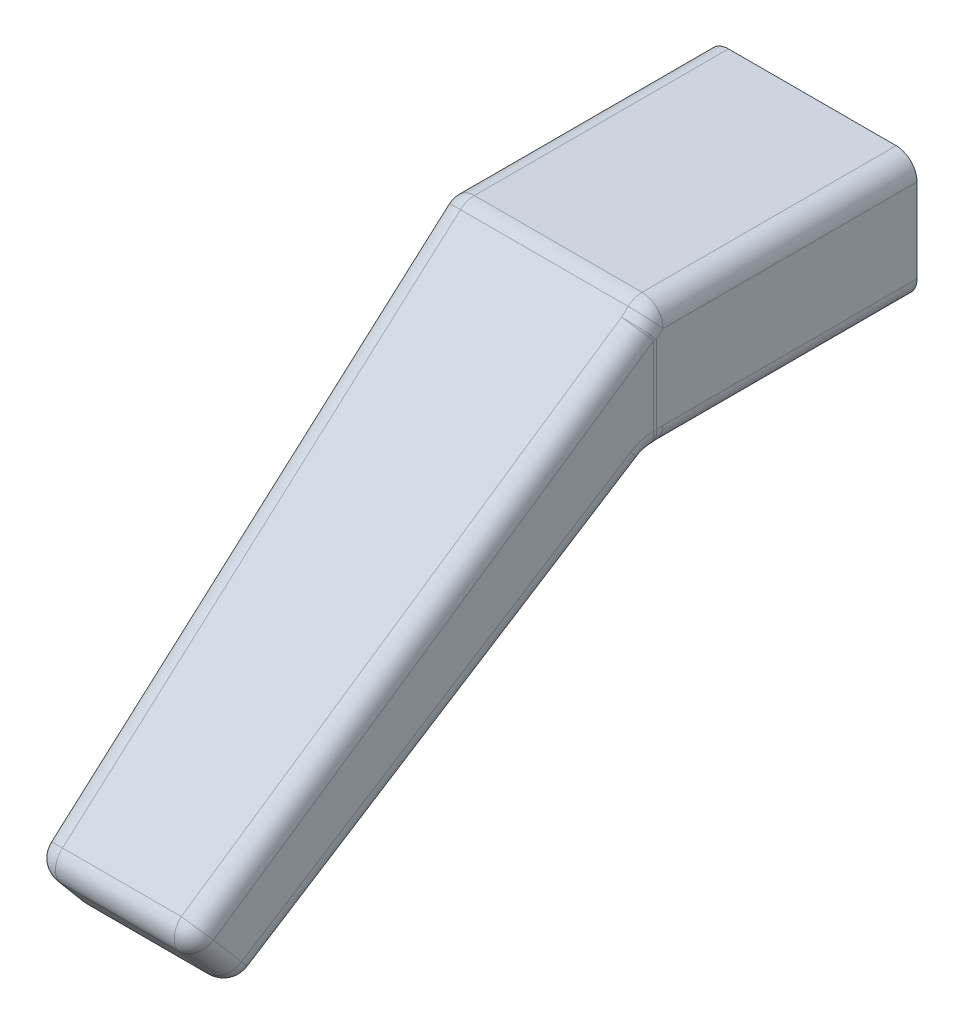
ISO-10303-21;
HEADER;
FILE_DESCRIPTION(('STEP AP214'),'2;1');
FILE_NAME('part.step','',(''),(''),'','','');
FILE_SCHEMA(('AUTOMOTIVE_DESIGN { 1 0 10303 214 1 1 1 1 }'));
ENDSEC;
DATA;
#1=APPLICATION_CONTEXT('core data for automotive mechanical design processes');
#2=APPLICATION_PROTOCOL_DEFINITION('international standard','automotive_design',2000,#1);
#3=PRODUCT_CONTEXT('',#1,'mechanical');
#4=PRODUCT('Part','Part','',(#3));
#5=PRODUCT_RELATED_PRODUCT_CATEGORY('part','',(#4));
#6=PRODUCT_DEFINITION_FORMATION('','',#4);
#7=PRODUCT_DEFINITION_CONTEXT('part definition',#1,'design');
#8=PRODUCT_DEFINITION('design','',#6,#7);
#9=PRODUCT_DEFINITION_SHAPE('','',#8);
#10=(LENGTH_UNIT() NAMED_UNIT(*) SI_UNIT(.MILLI.,.METRE.));
#11=(NAMED_UNIT(*) PLANE_ANGLE_UNIT() SI_UNIT($,.RADIAN.));
#12=(NAMED_UNIT(*) SI_UNIT($,.STERADIAN.) SOLID_ANGLE_UNIT());
#13=UNCERTAINTY_MEASURE_WITH_UNIT(LENGTH_MEASURE(1.E-05),#10,'distance_accuracy_value','');
#14=(GEOMETRIC_REPRESENTATION_CONTEXT(3) GLOBAL_UNCERTAINTY_ASSIGNED_CONTEXT((#13)) GLOBAL_UNIT_ASSIGNED_CONTEXT((#10,
#11,#12)) REPRESENTATION_CONTEXT('',''));
#15=CARTESIAN_POINT('',(0.,0.,0.));
#16=DIRECTION('',(0.,0.,1.));
#17=DIRECTION('',(1.,0.,0.));
#18=AXIS2_PLACEMENT_3D('',#15,#16,#17);
#19=CARTESIAN_POINT('',(0.,0.,12.));
#20=DIRECTION('',(0.,0.,-1.));
#21=DIRECTION('',(-1.,0.,0.));
#22=AXIS2_PLACEMENT_3D('',#19,#20,#21);
#23=PLANE('',#22);
#24=DIRECTION('',(1.,0.,0.));
#25=VECTOR('',#24,1.);
#26=CARTESIAN_POINT('',(0.,1.14934836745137,12.));
#27=LINE('',#26,#25);
#28=CARTESIAN_POINT('',(-8.09999998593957,1.14934836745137,12.));
#29=VERTEX_POINT('',#28);
#30=CARTESIAN_POINT('',(7.,1.14934836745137,12.));
#31=VERTEX_POINT('',#30);
#32=EDGE_CURVE('E384',#29,#31,#27,.T.);
#33=ORIENTED_EDGE('',*,*,#32,.F.);
#34=DIRECTION('',(0.,1.,0.));
#35=VECTOR('',#34,1.);
#36=CARTESIAN_POINT('',(-8.09999998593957,1.15,12.));
#37=LINE('',#36,#35);
#38=CARTESIAN_POINT('',(-8.09999998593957,1.15,12.));
#39=VERTEX_POINT('',#38);
#40=EDGE_CURVE('E329',#29,#39,#37,.T.);
#41=ORIENTED_EDGE('',*,*,#40,.T.);
#42=DIRECTION('',(0.999999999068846,-4.31544734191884E-05,0.));
#43=VECTOR('',#42,1.);
#44=CARTESIAN_POINT('',(7.,1.14934836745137,12.));
#45=LINE('',#44,#43);
#46=EDGE_CURVE('E332',#39,#31,#45,.T.);
#47=ORIENTED_EDGE('',*,*,#46,.T.);
#48=EDGE_LOOP('',(#33,#41,#47));
#49=FACE_BOUND('',#48,.T.);
#50=ADVANCED_FACE('F51',(#49),#23,.T.);
#51=CARTESIAN_POINT('',(-10.,-6.,25.));
#52=DIRECTION('',(-1.,0.,0.));
#53=DIRECTION('',(0.,0.,1.));
#54=AXIS2_PLACEMENT_3D('',#51,#52,#53);
#55=PLANE('',#54);
#56=DIRECTION('',(0.,-0.664451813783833,0.747331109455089));
#57=VECTOR('',#56,1.);
#58=CARTESIAN_POINT('',(-10.,4.,24.239466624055));
#59=LINE('',#58,#57);
#60=CARTESIAN_POINT('',(-10.,-29.7672537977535,62.218622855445));
#61=VERTEX_POINT('',#60);
#62=CARTESIAN_POINT('',(-10.,4.,24.239466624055));
#63=VERTEX_POINT('',#62);
#64=EDGE_CURVE('E525',#61,#63,#59,.F.);
#65=ORIENTED_EDGE('',*,*,#64,.T.);
#66=DIRECTION('',(0.,0.,-1.));
#67=VECTOR('',#66,1.);
#68=CARTESIAN_POINT('',(-10.,4.,25.));
#69=LINE('',#68,#67);
#70=CARTESIAN_POINT('',(-10.,4.,0.));
#71=VERTEX_POINT('',#70);
#72=EDGE_CURVE('E540',#63,#71,#69,.T.);
#73=ORIENTED_EDGE('',*,*,#72,.T.);
#74=DIRECTION('',(0.,1.,0.));
#75=VECTOR('',#74,1.);
#76=CARTESIAN_POINT('',(-10.,-6.,0.));
#77=LINE('',#76,#75);
#78=CARTESIAN_POINT('',(-10.,-4.,0.));
#79=VERTEX_POINT('',#78);
#80=EDGE_CURVE('E350',#79,#71,#77,.T.);
#81=ORIENTED_EDGE('',*,*,#80,.F.);
#82=DIRECTION('',(0.,0.,-1.));
#83=VECTOR('',#82,1.);
#84=CARTESIAN_POINT('',(-10.,-4.,24.2720595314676));
#85=LINE('',#84,#83);
#86=CARTESIAN_POINT('',(-10.,-4.,24.2720595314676));
#87=VERTEX_POINT('',#86);
#88=EDGE_CURVE('E537',#79,#87,#85,.F.);
#89=ORIENTED_EDGE('',*,*,#88,.T.);
#90=CARTESIAN_POINT('',(-10.,-8.,24.2720595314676));
#91=DIRECTION('',(-1.,0.,0.));
#92=DIRECTION('',(0.,0.,1.));
#93=AXIS2_PLACEMENT_3D('',#90,#91,#92);
#94=CIRCLE('',#93,4.);
#95=CARTESIAN_POINT('',(-10.,-4.9358222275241,26.8432099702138));
#96=VERTEX_POINT('',#95);
#97=EDGE_CURVE('E534',#87,#96,#94,.F.);
#98=ORIENTED_EDGE('',*,*,#97,.T.);
#99=DIRECTION('',(0.,-0.642787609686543,0.766044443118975));
#100=VECTOR('',#99,1.);
#101=CARTESIAN_POINT('',(-10.,-32.6145620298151,59.8294475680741));
#102=LINE('',#101,#100);
#103=CARTESIAN_POINT('',(-10.,-32.6145620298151,59.8294475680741));
#104=VERTEX_POINT('',#103);
#105=EDGE_CURVE('E531',#96,#104,#102,.T.);
#106=ORIENTED_EDGE('',*,*,#105,.T.);
#107=DIRECTION('',(0.,-0.766044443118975,-0.642787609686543));
#108=VECTOR('',#107,1.);
#109=CARTESIAN_POINT('',(-10.,-29.7672537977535,62.218622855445));
#110=LINE('',#109,#108);
#111=EDGE_CURVE('E528',#104,#61,#110,.F.);
#112=ORIENTED_EDGE('',*,*,#111,.T.);
#113=EDGE_LOOP('',(#65,#73,#81,#89,#98,#106,#112));
#114=FACE_BOUND('',#113,.T.);
#115=ADVANCED_FACE('F603',(#114),#55,.T.);
#116=CARTESIAN_POINT('',(-10.,-6.,25.));
#117=DIRECTION('',(0.,1.,0.));
#118=DIRECTION('',(0.,0.,1.));
#119=AXIS2_PLACEMENT_3D('',#116,#117,#118);
#120=PLANE('',#119);
#121=DIRECTION('',(0.,0.,-1.));
#122=VECTOR('',#121,1.);
#123=CARTESIAN_POINT('',(-8.,-6.,0.));
#124=LINE('',#123,#122);
#125=CARTESIAN_POINT('',(-8.,-6.,24.2720595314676));
#126=VERTEX_POINT('',#125);
#127=CARTESIAN_POINT('',(-8.,-6.,0.));
#128=VERTEX_POINT('',#127);
#129=EDGE_CURVE('E452',#126,#128,#124,.T.);
#130=ORIENTED_EDGE('',*,*,#129,.T.);
#131=DIRECTION('',(1.,0.,0.));
#132=VECTOR('',#131,1.);
#133=CARTESIAN_POINT('',(-10.,-6.,0.));
#134=LINE('',#133,#132);
#135=CARTESIAN_POINT('',(8.,-6.,0.));
#136=VERTEX_POINT('',#135);
#137=EDGE_CURVE('E377',#128,#136,#134,.T.);
#138=ORIENTED_EDGE('',*,*,#137,.T.);
#139=DIRECTION('',(0.,0.,-1.));
#140=VECTOR('',#139,1.);
#141=CARTESIAN_POINT('',(8.,-6.,25.));
#142=LINE('',#141,#140);
#143=CARTESIAN_POINT('',(8.,-6.,24.2720595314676));
#144=VERTEX_POINT('',#143);
#145=EDGE_CURVE('E456',#136,#144,#142,.F.);
#146=ORIENTED_EDGE('',*,*,#145,.T.);
#147=DIRECTION('',(1.,0.,0.));
#148=VECTOR('',#147,1.);
#149=CARTESIAN_POINT('',(-10.,-6.,24.2720595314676));
#150=LINE('',#149,#148);
#151=EDGE_CURVE('E423',#144,#126,#150,.F.);
#152=ORIENTED_EDGE('',*,*,#151,.T.);
#153=EDGE_LOOP('',(#130,#138,#146,#152));
#154=FACE_BOUND('',#153,.T.);
#155=DIRECTION('',(0.,0.,-1.));
#156=VECTOR('',#155,1.);
#157=CARTESIAN_POINT('',(7.,-6.,12.));
#158=LINE('',#157,#156);
#159=CARTESIAN_POINT('',(7.,-6.,12.));
#160=VERTEX_POINT('',#159);
#161=CARTESIAN_POINT('',(7.,-6.,10.));
#162=VERTEX_POINT('',#161);
#163=EDGE_CURVE('E336',#160,#162,#158,.T.);
#164=ORIENTED_EDGE('',*,*,#163,.T.);
#165=DIRECTION('',(-1.,0.,0.));
#166=VECTOR('',#165,1.);
#167=CARTESIAN_POINT('',(4.65,-6.,10.));
#168=LINE('',#167,#166);
#169=CARTESIAN_POINT('',(4.65,-6.,10.));
#170=VERTEX_POINT('',#169);
#171=EDGE_CURVE('E276',#162,#170,#168,.T.);
#172=ORIENTED_EDGE('',*,*,#171,.T.);
#173=DIRECTION('',(0.,0.,-1.));
#174=VECTOR('',#173,1.);
#175=CARTESIAN_POINT('',(4.65,-6.,12.));
#176=LINE('',#175,#174);
#177=CARTESIAN_POINT('',(4.65,-6.,12.));
#178=VERTEX_POINT('',#177);
#179=EDGE_CURVE('E361',#178,#170,#176,.T.);
#180=ORIENTED_EDGE('',*,*,#179,.F.);
#181=DIRECTION('',(-1.,0.,0.));
#182=VECTOR('',#181,1.);
#183=CARTESIAN_POINT('',(4.65,-6.,12.));
#184=LINE('',#183,#182);
#185=EDGE_CURVE('E320',#160,#178,#184,.T.);
#186=ORIENTED_EDGE('',*,*,#185,.F.);
#187=EDGE_LOOP('',(#164,#172,#180,#186));
#188=FACE_BOUND('',#187,.T.);
#189=ADVANCED_FACE('F610',(#154,#188),#120,.F.);
#190=CARTESIAN_POINT('',(10.,-6.,25.));
#191=DIRECTION('',(-1.,0.,0.));
#192=DIRECTION('',(0.,0.,1.));
#193=AXIS2_PLACEMENT_3D('',#190,#191,#192);
#194=PLANE('',#193);
#195=CARTESIAN_POINT('',(10.,-8.,24.2720595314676));
#196=DIRECTION('',(-1.,0.,0.));
#197=DIRECTION('',(0.,0.,1.));
#198=AXIS2_PLACEMENT_3D('',#195,#196,#197);
#199=CIRCLE('',#198,4.);
#200=CARTESIAN_POINT('',(10.,-4.04577715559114,24.8754845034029));
#201=VERTEX_POINT('',#200);
#202=CARTESIAN_POINT('',(10.,-4.,24.2720595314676));
#203=VERTEX_POINT('',#202);
#204=EDGE_CURVE('E433',#201,#203,#199,.T.);
#205=ORIENTED_EDGE('',*,*,#204,.T.);
#206=DIRECTION('',(0.,0.,-1.));
#207=VECTOR('',#206,1.);
#208=CARTESIAN_POINT('',(10.,-4.,25.));
#209=LINE('',#208,#207);
#210=CARTESIAN_POINT('',(10.,-4.,0.));
#211=VERTEX_POINT('',#210);
#212=EDGE_CURVE('E436',#203,#211,#209,.T.);
#213=ORIENTED_EDGE('',*,*,#212,.T.);
#214=DIRECTION('',(0.,1.,0.));
#215=VECTOR('',#214,1.);
#216=CARTESIAN_POINT('',(10.,-6.,0.));
#217=LINE('',#216,#215);
#218=CARTESIAN_POINT('',(10.,4.,0.));
#219=VERTEX_POINT('',#218);
#220=EDGE_CURVE('E373',#211,#219,#217,.T.);
#221=ORIENTED_EDGE('',*,*,#220,.T.);
#222=DIRECTION('',(0.,0.,-1.));
#223=VECTOR('',#222,1.);
#224=CARTESIAN_POINT('',(10.,4.,24.239466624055));
#225=LINE('',#224,#223);
#226=CARTESIAN_POINT('',(10.,4.,24.239466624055));
#227=VERTEX_POINT('',#226);
#228=EDGE_CURVE('E427',#219,#227,#225,.F.);
#229=ORIENTED_EDGE('',*,*,#228,.T.);
#230=DIRECTION('',(0.,-0.664451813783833,0.747331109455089));
#231=VECTOR('',#230,1.);
#232=CARTESIAN_POINT('',(10.,-0.792616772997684,29.6298825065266));
#233=LINE('',#232,#231);
#234=CARTESIAN_POINT('',(10.,3.4345167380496,24.8754845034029));
#235=VERTEX_POINT('',#234);
#236=EDGE_CURVE('E430',#227,#235,#233,.T.);
#237=ORIENTED_EDGE('',*,*,#236,.T.);
#238=DIRECTION('',(0.,1.,0.));
#239=VECTOR('',#238,1.);
#240=CARTESIAN_POINT('',(10.,-6.,24.8754845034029));
#241=LINE('',#240,#239);
#242=EDGE_CURVE('E415',#235,#201,#241,.F.);
#243=ORIENTED_EDGE('',*,*,#242,.T.);
#244=EDGE_LOOP('',(#205,#213,#221,#229,#237,#243));
#245=FACE_BOUND('',#244,.T.);
#246=ADVANCED_FACE('F765',(#245),#194,.F.);
#247=CARTESIAN_POINT('',(-10.,6.,25.));
#248=DIRECTION('',(0.,1.,0.));
#249=DIRECTION('',(0.,0.,1.));
#250=AXIS2_PLACEMENT_3D('',#247,#248,#249);
#251=PLANE('',#250);
#252=DIRECTION('',(1.,0.,0.));
#253=VECTOR('',#252,1.);
#254=CARTESIAN_POINT('',(-10.,6.,0.));
#255=LINE('',#254,#253);
#256=CARTESIAN_POINT('',(-8.,6.,0.));
#257=VERTEX_POINT('',#256);
#258=CARTESIAN_POINT('',(8.,6.,0.));
#259=VERTEX_POINT('',#258);
#260=EDGE_CURVE('E369',#257,#259,#255,.T.);
#261=ORIENTED_EDGE('',*,*,#260,.F.);
#262=DIRECTION('',(0.,0.,-1.));
#263=VECTOR('',#262,1.);
#264=CARTESIAN_POINT('',(-8.,6.,25.));
#265=LINE('',#264,#263);
#266=CARTESIAN_POINT('',(-8.,6.,24.239466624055));
#267=VERTEX_POINT('',#266);
#268=EDGE_CURVE('E12',#257,#267,#265,.F.);
#269=ORIENTED_EDGE('',*,*,#268,.T.);
#270=DIRECTION('',(1.,0.,0.));
#271=VECTOR('',#270,1.);
#272=CARTESIAN_POINT('',(9.99999999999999,6.,24.239466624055));
#273=LINE('',#272,#271);
#274=CARTESIAN_POINT('',(8.,6.,24.239466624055));
#275=VERTEX_POINT('',#274);
#276=EDGE_CURVE('E419',#267,#275,#273,.T.);
#277=ORIENTED_EDGE('',*,*,#276,.T.);
#278=DIRECTION('',(0.,0.,-1.));
#279=VECTOR('',#278,1.);
#280=CARTESIAN_POINT('',(8.,6.,0.));
#281=LINE('',#280,#279);
#282=EDGE_CURVE('E61',#275,#259,#281,.T.);
#283=ORIENTED_EDGE('',*,*,#282,.T.);
#284=EDGE_LOOP('',(#261,#269,#277,#283));
#285=FACE_BOUND('',#284,.T.);
#286=ADVANCED_FACE('F711',(#285),#251,.T.);
#287=CARTESIAN_POINT('',(0.,0.,0.));
#288=DIRECTION('',(0.,0.,-1.));
#289=DIRECTION('',(-1.,0.,0.));
#290=AXIS2_PLACEMENT_3D('',#287,#288,#289);
#291=PLANE('',#290);
#292=ORIENTED_EDGE('',*,*,#137,.F.);
#293=CARTESIAN_POINT('',(-8.,-4.,0.));
#294=DIRECTION('',(0.,0.,-1.));
#295=DIRECTION('',(-1.,0.,0.));
#296=AXIS2_PLACEMENT_3D('',#293,#294,#295);
#297=CIRCLE('',#296,2.);
#298=EDGE_CURVE('E443',#128,#79,#297,.T.);
#299=ORIENTED_EDGE('',*,*,#298,.T.);
#300=ORIENTED_EDGE('',*,*,#80,.T.);
#301=CARTESIAN_POINT('',(-8.,4.,0.));
#302=DIRECTION('',(0.,0.,-1.));
#303=DIRECTION('',(-1.,0.,0.));
#304=AXIS2_PLACEMENT_3D('',#301,#302,#303);
#305=CIRCLE('',#304,2.);
#306=EDGE_CURVE('E446',#71,#257,#305,.T.);
#307=ORIENTED_EDGE('',*,*,#306,.T.);
#308=ORIENTED_EDGE('',*,*,#260,.T.);
#309=CARTESIAN_POINT('',(8.,4.,0.));
#310=DIRECTION('',(0.,0.,-1.));
#311=DIRECTION('',(-1.,0.,0.));
#312=AXIS2_PLACEMENT_3D('',#309,#310,#311);
#313=CIRCLE('',#312,2.);
#314=EDGE_CURVE('E440',#259,#219,#313,.T.);
#315=ORIENTED_EDGE('',*,*,#314,.T.);
#316=ORIENTED_EDGE('',*,*,#220,.F.);
#317=CARTESIAN_POINT('',(8.,-4.,0.));
#318=DIRECTION('',(0.,0.,-1.));
#319=DIRECTION('',(-1.,0.,0.));
#320=AXIS2_PLACEMENT_3D('',#317,#318,#319);
#321=CIRCLE('',#320,2.);
#322=EDGE_CURVE('E449',#211,#136,#321,.T.);
#323=ORIENTED_EDGE('',*,*,#322,.T.);
#324=EDGE_LOOP('',(#292,#299,#300,#307,#308,#315,#316,#323));
#325=FACE_BOUND('',#324,.T.);
#326=DIRECTION('',(1.,0.,0.));
#327=VECTOR('',#326,1.);
#328=CARTESIAN_POINT('',(4.65,-5.5,0.));
#329=LINE('',#328,#327);
#330=CARTESIAN_POINT('',(4.65,-5.5,0.));
#331=VERTEX_POINT('',#330);
#332=CARTESIAN_POINT('',(7.,-5.5,0.));
#333=VERTEX_POINT('',#332);
#334=EDGE_CURVE('E257',#331,#333,#329,.T.);
#335=ORIENTED_EDGE('',*,*,#334,.T.);
#336=DIRECTION('',(0.,-1.,0.));
#337=VECTOR('',#336,1.);
#338=CARTESIAN_POINT('',(7.,-6.,0.));
#339=LINE('',#338,#337);
#340=CARTESIAN_POINT('',(7.,1.14934836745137,0.));
#341=VERTEX_POINT('',#340);
#342=EDGE_CURVE('E265',#341,#333,#339,.T.);
#343=ORIENTED_EDGE('',*,*,#342,.F.);
#344=DIRECTION('',(0.999999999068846,-4.31544734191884E-05,0.));
#345=VECTOR('',#344,1.);
#346=CARTESIAN_POINT('',(7.,1.14934836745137,0.));
#347=LINE('',#346,#345);
#348=CARTESIAN_POINT('',(-8.09999998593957,1.15,0.));
#349=VERTEX_POINT('',#348);
#350=EDGE_CURVE('E321',#349,#341,#347,.T.);
#351=ORIENTED_EDGE('',*,*,#350,.F.);
#352=DIRECTION('',(0.,1.,0.));
#353=VECTOR('',#352,1.);
#354=CARTESIAN_POINT('',(-8.09999998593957,1.15,0.));
#355=LINE('',#354,#353);
#356=CARTESIAN_POINT('',(-8.09999998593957,-1.15,0.));
#357=VERTEX_POINT('',#356);
#358=EDGE_CURVE('E341',#357,#349,#355,.T.);
#359=ORIENTED_EDGE('',*,*,#358,.F.);
#360=DIRECTION('',(-1.,0.,0.));
#361=VECTOR('',#360,1.);
#362=CARTESIAN_POINT('',(-8.09999998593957,-1.15,0.));
#363=LINE('',#362,#361);
#364=CARTESIAN_POINT('',(4.65000000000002,-1.15,0.));
#365=VERTEX_POINT('',#364);
#366=EDGE_CURVE('E260',#365,#357,#363,.T.);
#367=ORIENTED_EDGE('',*,*,#366,.F.);
#368=DIRECTION('',(0.,1.,0.));
#369=VECTOR('',#368,1.);
#370=CARTESIAN_POINT('',(4.65000000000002,-1.15,0.));
#371=LINE('',#370,#369);
#372=EDGE_CURVE('E252',#331,#365,#371,.T.);
#373=ORIENTED_EDGE('',*,*,#372,.F.);
#374=EDGE_LOOP('',(#335,#343,#351,#359,#367,#373));
#375=FACE_BOUND('',#374,.T.);
#376=ADVANCED_FACE('F254',(#325,#375),#291,.T.);
#377=CARTESIAN_POINT('',(7.,-6.,12.));
#378=DIRECTION('',(1.,0.,0.));
#379=DIRECTION('',(0.,1.,0.));
#380=AXIS2_PLACEMENT_3D('',#377,#378,#379);
#381=PLANE('',#380);
#382=ORIENTED_EDGE('',*,*,#342,.T.);
#383=DIRECTION('',(0.,0.,-1.));
#384=VECTOR('',#383,1.);
#385=CARTESIAN_POINT('',(7.,-5.5,10.));
#386=LINE('',#385,#384);
#387=CARTESIAN_POINT('',(7.,-5.5,10.));
#388=VERTEX_POINT('',#387);
#389=EDGE_CURVE('E69',#388,#333,#386,.T.);
#390=ORIENTED_EDGE('',*,*,#389,.F.);
#391=DIRECTION('',(0.,-1.,0.));
#392=VECTOR('',#391,1.);
#393=CARTESIAN_POINT('',(7.,-6.,10.));
#394=LINE('',#393,#392);
#395=EDGE_CURVE('E73',#388,#162,#394,.T.);
#396=ORIENTED_EDGE('',*,*,#395,.T.);
#397=ORIENTED_EDGE('',*,*,#163,.F.);
#398=DIRECTION('',(0.,-1.,0.));
#399=VECTOR('',#398,1.);
#400=CARTESIAN_POINT('',(7.,-6.,12.));
#401=LINE('',#400,#399);
#402=CARTESIAN_POINT('',(7.,-1.15,12.));
#403=VERTEX_POINT('',#402);
#404=EDGE_CURVE('E317',#403,#160,#401,.T.);
#405=ORIENTED_EDGE('',*,*,#404,.F.);
#406=DIRECTION('',(0.,0.,-1.));
#407=VECTOR('',#406,1.);
#408=CARTESIAN_POINT('',(7.,-1.15,25.));
#409=LINE('',#408,#407);
#410=CARTESIAN_POINT('',(7.,-1.15,25.));
#411=VERTEX_POINT('',#410);
#412=EDGE_CURVE('E307',#411,#403,#409,.T.);
#413=ORIENTED_EDGE('',*,*,#412,.F.);
#414=DIRECTION('',(0.,-1.,0.));
#415=VECTOR('',#414,1.);
#416=CARTESIAN_POINT('',(7.,1.14934836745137,25.));
#417=LINE('',#416,#415);
#418=CARTESIAN_POINT('',(7.,1.14934836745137,25.));
#419=VERTEX_POINT('',#418);
#420=EDGE_CURVE('E290',#419,#411,#417,.T.);
#421=ORIENTED_EDGE('',*,*,#420,.F.);
#422=DIRECTION('',(0.,0.,-1.));
#423=VECTOR('',#422,1.);
#424=CARTESIAN_POINT('',(7.,1.14934836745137,25.));
#425=LINE('',#424,#423);
#426=EDGE_CURVE('E308',#419,#31,#425,.T.);
#427=ORIENTED_EDGE('',*,*,#426,.T.);
#428=DIRECTION('',(0.,0.,-1.));
#429=VECTOR('',#428,1.);
#430=CARTESIAN_POINT('',(7.,1.14934836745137,12.));
#431=LINE('',#430,#429);
#432=EDGE_CURVE('E347',#31,#341,#431,.T.);
#433=ORIENTED_EDGE('',*,*,#432,.T.);
#434=EDGE_LOOP('',(#382,#390,#396,#397,#405,#413,#421,#427,#433));
#435=FACE_BOUND('',#434,.T.);
#436=ADVANCED_FACE('F628',(#435),#381,.F.);
#437=CARTESIAN_POINT('',(7.,1.14934836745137,12.));
#438=DIRECTION('',(4.31544734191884E-05,0.999999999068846,0.));
#439=DIRECTION('',(-0.999999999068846,4.31544734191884E-05,0.));
#440=AXIS2_PLACEMENT_3D('',#437,#438,#439);
#441=PLANE('',#440);
#442=ORIENTED_EDGE('',*,*,#350,.T.);
#443=ORIENTED_EDGE('',*,*,#432,.F.);
#444=ORIENTED_EDGE('',*,*,#46,.F.);
#445=DIRECTION('',(0.,0.,-1.));
#446=VECTOR('',#445,1.);
#447=CARTESIAN_POINT('',(-8.09999998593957,1.15,12.));
#448=LINE('',#447,#446);
#449=EDGE_CURVE('E351',#39,#349,#448,.T.);
#450=ORIENTED_EDGE('',*,*,#449,.T.);
#451=EDGE_LOOP('',(#442,#443,#444,#450));
#452=FACE_BOUND('',#451,.T.);
#453=ADVANCED_FACE('F1073',(#452),#441,.F.);
#454=CARTESIAN_POINT('',(-8.09999998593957,1.15,12.));
#455=DIRECTION('',(-1.,0.,0.));
#456=DIRECTION('',(0.,-1.,0.));
#457=AXIS2_PLACEMENT_3D('',#454,#455,#456);
#458=PLANE('',#457);
#459=ORIENTED_EDGE('',*,*,#40,.F.);
#460=DIRECTION('',(0.,0.,-1.));
#461=VECTOR('',#460,1.);
#462=CARTESIAN_POINT('',(-8.09999998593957,1.14934836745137,25.));
#463=LINE('',#462,#461);
#464=CARTESIAN_POINT('',(-8.09999998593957,1.14934836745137,25.));
#465=VERTEX_POINT('',#464);
#466=EDGE_CURVE('E312',#465,#29,#463,.T.);
#467=ORIENTED_EDGE('',*,*,#466,.F.);
#468=DIRECTION('',(0.,1.,0.));
#469=VECTOR('',#468,1.);
#470=CARTESIAN_POINT('',(-8.09999998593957,1.14934836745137,25.));
#471=LINE('',#470,#469);
#472=CARTESIAN_POINT('',(-8.09999998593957,-1.15,25.));
#473=VERTEX_POINT('',#472);
#474=EDGE_CURVE('E299',#473,#465,#471,.T.);
#475=ORIENTED_EDGE('',*,*,#474,.F.);
#476=DIRECTION('',(0.,0.,-1.));
#477=VECTOR('',#476,1.);
#478=CARTESIAN_POINT('',(-8.09999998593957,-1.15,12.));
#479=LINE('',#478,#477);
#480=EDGE_CURVE('E355',#473,#357,#479,.T.);
#481=ORIENTED_EDGE('',*,*,#480,.T.);
#482=ORIENTED_EDGE('',*,*,#358,.T.);
#483=ORIENTED_EDGE('',*,*,#449,.F.);
#484=EDGE_LOOP('',(#459,#467,#475,#481,#482,#483));
#485=FACE_BOUND('',#484,.T.);
#486=ADVANCED_FACE('F1063',(#485),#458,.F.);
#487=CARTESIAN_POINT('',(-8.09999998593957,-1.15,12.));
#488=DIRECTION('',(0.,-1.,0.));
#489=DIRECTION('',(1.,0.,0.));
#490=AXIS2_PLACEMENT_3D('',#487,#488,#489);
#491=PLANE('',#490);
#492=ORIENTED_EDGE('',*,*,#366,.T.);
#493=ORIENTED_EDGE('',*,*,#480,.F.);
#494=DIRECTION('',(-1.,0.,0.));
#495=VECTOR('',#494,1.);
#496=CARTESIAN_POINT('',(7.,-1.15,25.));
#497=LINE('',#496,#495);
#498=EDGE_CURVE('E294',#411,#473,#497,.T.);
#499=ORIENTED_EDGE('',*,*,#498,.F.);
#500=ORIENTED_EDGE('',*,*,#412,.T.);
#501=DIRECTION('',(-1.,0.,0.));
#502=VECTOR('',#501,1.);
#503=CARTESIAN_POINT('',(0.,-1.15,12.));
#504=LINE('',#503,#502);
#505=CARTESIAN_POINT('',(4.65000000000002,-1.15,12.));
#506=VERTEX_POINT('',#505);
#507=EDGE_CURVE('E381',#403,#506,#504,.T.);
#508=ORIENTED_EDGE('',*,*,#507,.T.);
#509=DIRECTION('',(0.,0.,-1.));
#510=VECTOR('',#509,1.);
#511=CARTESIAN_POINT('',(4.65000000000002,-1.15,12.));
#512=LINE('',#511,#510);
#513=EDGE_CURVE('E358',#506,#365,#512,.T.);
#514=ORIENTED_EDGE('',*,*,#513,.T.);
#515=EDGE_LOOP('',(#492,#493,#499,#500,#508,#514));
#516=FACE_BOUND('',#515,.T.);
#517=ADVANCED_FACE('F623',(#516),#491,.F.);
#518=CARTESIAN_POINT('',(4.65000000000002,-1.15,12.));
#519=DIRECTION('',(-1.,0.,0.));
#520=DIRECTION('',(0.,-1.,0.));
#521=AXIS2_PLACEMENT_3D('',#518,#519,#520);
#522=PLANE('',#521);
#523=DIRECTION('',(0.,1.,0.));
#524=VECTOR('',#523,1.);
#525=CARTESIAN_POINT('',(4.65,-6.,10.));
#526=LINE('',#525,#524);
#527=CARTESIAN_POINT('',(4.65,-5.5,10.));
#528=VERTEX_POINT('',#527);
#529=EDGE_CURVE('E271',#170,#528,#526,.T.);
#530=ORIENTED_EDGE('',*,*,#529,.T.);
#531=DIRECTION('',(0.,0.,-1.));
#532=VECTOR('',#531,1.);
#533=CARTESIAN_POINT('',(4.65,-5.5,10.));
#534=LINE('',#533,#532);
#535=EDGE_CURVE('E268',#528,#331,#534,.T.);
#536=ORIENTED_EDGE('',*,*,#535,.T.);
#537=ORIENTED_EDGE('',*,*,#372,.T.);
#538=ORIENTED_EDGE('',*,*,#513,.F.);
#539=DIRECTION('',(0.,1.,0.));
#540=VECTOR('',#539,1.);
#541=CARTESIAN_POINT('',(4.65000000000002,-1.15,12.));
#542=LINE('',#541,#540);
#543=EDGE_CURVE('E325',#178,#506,#542,.T.);
#544=ORIENTED_EDGE('',*,*,#543,.F.);
#545=ORIENTED_EDGE('',*,*,#179,.T.);
#546=EDGE_LOOP('',(#530,#536,#537,#538,#544,#545));
#547=FACE_BOUND('',#546,.T.);
#548=ADVANCED_FACE('F269',(#547),#522,.F.);
#549=ORIENTED_EDGE('',*,*,#507,.F.);
#550=ORIENTED_EDGE('',*,*,#404,.T.);
#551=ORIENTED_EDGE('',*,*,#185,.T.);
#552=ORIENTED_EDGE('',*,*,#543,.T.);
#553=EDGE_LOOP('',(#549,#550,#551,#552));
#554=FACE_BOUND('',#553,.T.);
#555=ADVANCED_FACE('F606',(#554),#23,.T.);
#556=CARTESIAN_POINT('',(0.,15.7651605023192,14.0167983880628));
#557=DIRECTION('',(0.,-0.747331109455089,-0.664451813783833));
#558=DIRECTION('',(0.,0.664451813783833,-0.747331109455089));
#559=AXIS2_PLACEMENT_3D('',#556,#557,#558);
#560=PLANE('',#559);
#561=DIRECTION('',(-1.,0.,0.));
#562=VECTOR('',#561,1.);
#563=CARTESIAN_POINT('',(0.,-28.2725915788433,63.5475264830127));
#564=LINE('',#563,#562);
#565=CARTESIAN_POINT('',(-8.,-28.2725915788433,63.5475264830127));
#566=VERTEX_POINT('',#565);
#567=CARTESIAN_POINT('',(3.33210770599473,-28.2725915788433,63.5475264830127));
#568=VERTEX_POINT('',#567);
#569=EDGE_CURVE('E411',#566,#568,#564,.F.);
#570=ORIENTED_EDGE('',*,*,#569,.T.);
#571=DIRECTION('',(-0.0930114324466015,-0.661571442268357,0.744091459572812));
#572=VECTOR('',#571,1.);
#573=CARTESIAN_POINT('',(9.44106015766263,15.1791473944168,14.6759068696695));
#574=LINE('',#573,#572);
#575=CARTESIAN_POINT('',(8.,4.92917895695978,26.2043881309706));
#576=VERTEX_POINT('',#575);
#577=EDGE_CURVE('E516',#568,#576,#574,.F.);
#578=ORIENTED_EDGE('',*,*,#577,.T.);
#579=DIRECTION('',(0.,-0.664451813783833,0.747331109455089));
#580=VECTOR('',#579,1.);
#581=CARTESIAN_POINT('',(8.,15.7651605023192,14.0167983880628));
#582=LINE('',#581,#580);
#583=CARTESIAN_POINT('',(8.,5.49466221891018,25.5683702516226));
#584=VERTEX_POINT('',#583);
#585=EDGE_CURVE('E513',#576,#584,#582,.F.);
#586=ORIENTED_EDGE('',*,*,#585,.T.);
#587=DIRECTION('',(1.,0.,0.));
#588=VECTOR('',#587,1.);
#589=CARTESIAN_POINT('',(-10.,5.49466221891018,25.5683702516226));
#590=LINE('',#589,#588);
#591=CARTESIAN_POINT('',(-8.,5.49466221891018,25.5683702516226));
#592=VERTEX_POINT('',#591);
#593=EDGE_CURVE('E407',#584,#592,#590,.F.);
#594=ORIENTED_EDGE('',*,*,#593,.T.);
#595=DIRECTION('',(0.,-0.664451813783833,0.747331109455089));
#596=VECTOR('',#595,1.);
#597=CARTESIAN_POINT('',(-8.,-28.2725915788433,63.5475264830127));
#598=LINE('',#597,#596);
#599=EDGE_CURVE('E510',#592,#566,#598,.T.);
#600=ORIENTED_EDGE('',*,*,#599,.T.);
#601=EDGE_LOOP('',(#570,#578,#586,#594,#600));
#602=FACE_BOUND('',#601,.T.);
#603=ADVANCED_FACE('F616',(#602),#560,.F.);
#604=CARTESIAN_POINT('',(12.9230769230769,0.,1.61538461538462));
#605=DIRECTION('',(-0.992277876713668,0.,-0.124034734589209));
#606=DIRECTION('',(-0.124034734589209,0.,0.992277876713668));
#607=AXIS2_PLACEMENT_3D('',#604,#605,#606);
#608=PLANE('',#607);
#609=DIRECTION('',(-0.0953195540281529,-0.639860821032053,0.762556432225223));
#610=VECTOR('',#609,1.);
#611=CARTESIAN_POINT('',(11.9203203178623,9.70969014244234,9.6374374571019));
#612=LINE('',#611,#610);
#613=CARTESIAN_POINT('',(5.61531037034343,-32.6145620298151,60.0775170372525));
#614=VERTEX_POINT('',#613);
#615=CARTESIAN_POINT('',(9.73859007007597,-4.9358222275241,27.0912794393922));
#616=VERTEX_POINT('',#615);
#617=EDGE_CURVE('E480',#614,#616,#612,.F.);
#618=ORIENTED_EDGE('',*,*,#617,.T.);
#619=CARTESIAN_POINT('',(10.0599838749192,-8.,24.520129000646));
#620=DIRECTION('',(-0.992277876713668,0.,-0.124034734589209));
#621=DIRECTION('',(-0.124034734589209,0.,0.992277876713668));
#622=AXIS2_PLACEMENT_3D('',#619,#620,#621);
#623=ELLIPSE('',#622,4.03112887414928,4.);
#624=CARTESIAN_POINT('',(9.98455575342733,-4.04577715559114,25.1235539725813));
#625=VERTEX_POINT('',#624);
#626=EDGE_CURVE('E483',#616,#625,#623,.T.);
#627=ORIENTED_EDGE('',*,*,#626,.T.);
#628=DIRECTION('',(0.,1.,0.));
#629=VECTOR('',#628,1.);
#630=CARTESIAN_POINT('',(9.98455575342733,0.,25.1235539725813));
#631=LINE('',#630,#629);
#632=CARTESIAN_POINT('',(9.98455575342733,3.4345167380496,25.1235539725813));
#633=VERTEX_POINT('',#632);
#634=EDGE_CURVE('E403',#625,#633,#631,.T.);
#635=ORIENTED_EDGE('',*,*,#634,.T.);
#636=DIRECTION('',(-0.0930114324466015,-0.661571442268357,0.744091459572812));
#637=VECTOR('',#636,1.);
#638=CARTESIAN_POINT('',(11.42561591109,13.6844851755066,13.5950727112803));
#639=LINE('',#638,#637);
#640=CARTESIAN_POINT('',(5.31666345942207,-29.7672537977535,62.4666923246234));
#641=VERTEX_POINT('',#640);
#642=EDGE_CURVE('E474',#633,#641,#639,.T.);
#643=ORIENTED_EDGE('',*,*,#642,.T.);
#644=DIRECTION('',(0.080090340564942,-0.763583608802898,-0.640722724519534));
#645=VECTOR('',#644,1.);
#646=CARTESIAN_POINT('',(6.66764565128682,-42.6475568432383,51.6588347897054));
#647=LINE('',#646,#645);
#648=EDGE_CURVE('E477',#641,#614,#647,.T.);
#649=ORIENTED_EDGE('',*,*,#648,.T.);
#650=EDGE_LOOP('',(#618,#627,#635,#643,#649));
#651=FACE_BOUND('',#650,.T.);
#652=ADVANCED_FACE('F578',(#651),#608,.F.);
#653=CARTESIAN_POINT('',(0.,8.78915237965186,7.37497452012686));
#654=DIRECTION('',(0.,0.766044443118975,0.642787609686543));
#655=DIRECTION('',(0.,-0.642787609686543,0.766044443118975));
#656=AXIS2_PLACEMENT_3D('',#653,#654,#655);
#657=PLANE('',#656);
#658=DIRECTION('',(1.,0.,0.));
#659=VECTOR('',#658,1.);
#660=CARTESIAN_POINT('',(10.,-6.46791111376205,25.5576347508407));
#661=LINE('',#660,#659);
#662=CARTESIAN_POINT('',(-8.00000000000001,-6.46791111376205,25.5576347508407));
#663=VERTEX_POINT('',#662);
#664=CARTESIAN_POINT('',(7.75403431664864,-6.46791111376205,25.5576347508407));
#665=VERTEX_POINT('',#664);
#666=EDGE_CURVE('E387',#663,#665,#661,.T.);
#667=ORIENTED_EDGE('',*,*,#666,.T.);
#668=DIRECTION('',(-0.0953195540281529,-0.639860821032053,0.762556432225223));
#669=VECTOR('',#668,1.);
#670=CARTESIAN_POINT('',(9.93576456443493,8.17760125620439,8.1037927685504));
#671=LINE('',#670,#669);
#672=CARTESIAN_POINT('',(3.6307546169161,-34.146650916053,58.543872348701));
#673=VERTEX_POINT('',#672);
#674=EDGE_CURVE('E489',#665,#673,#671,.T.);
#675=ORIENTED_EDGE('',*,*,#674,.T.);
#676=DIRECTION('',(-1.,0.,0.));
#677=VECTOR('',#676,1.);
#678=CARTESIAN_POINT('',(0.,-34.146650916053,58.543872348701));
#679=LINE('',#678,#677);
#680=CARTESIAN_POINT('',(-8.,-34.146650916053,58.543872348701));
#681=VERTEX_POINT('',#680);
#682=EDGE_CURVE('E391',#673,#681,#679,.T.);
#683=ORIENTED_EDGE('',*,*,#682,.T.);
#684=DIRECTION('',(0.,-0.642787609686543,0.766044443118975));
#685=VECTOR('',#684,1.);
#686=CARTESIAN_POINT('',(-8.,-6.46791111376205,25.5576347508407));
#687=LINE('',#686,#685);
#688=EDGE_CURVE('E486',#681,#663,#687,.F.);
#689=ORIENTED_EDGE('',*,*,#688,.T.);
#690=EDGE_LOOP('',(#667,#675,#683,#689));
#691=FACE_BOUND('',#690,.T.);
#692=ADVANCED_FACE('F813',(#691),#657,.F.);
#693=CARTESIAN_POINT('',(-10.0001,-29.5639852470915,65.));
#694=DIRECTION('',(0.,0.642787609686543,-0.766044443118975));
#695=DIRECTION('',(0.,0.766044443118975,0.642787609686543));
#696=AXIS2_PLACEMENT_3D('',#693,#694,#695);
#697=PLANE('',#696);
#698=DIRECTION('',(-1.,0.,0.));
#699=VECTOR('',#698,1.);
#700=CARTESIAN_POINT('',(-10.0001,-33.9001372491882,61.361536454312));
#701=LINE('',#700,#699);
#702=CARTESIAN_POINT('',(-8.,-33.9001372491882,61.361536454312));
#703=VERTEX_POINT('',#702);
#704=CARTESIAN_POINT('',(3.6307546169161,-33.9001372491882,61.361536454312));
#705=VERTEX_POINT('',#704);
#706=EDGE_CURVE('E399',#703,#705,#701,.F.);
#707=ORIENTED_EDGE('',*,*,#706,.T.);
#708=DIRECTION('',(0.080090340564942,-0.763583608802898,-0.640722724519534));
#709=VECTOR('',#708,1.);
#710=CARTESIAN_POINT('',(3.09142941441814,-28.7581952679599,65.6761380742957));
#711=LINE('',#710,#709);
#712=CARTESIAN_POINT('',(3.33210770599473,-31.0528290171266,63.750711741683));
#713=VERTEX_POINT('',#712);
#714=EDGE_CURVE('E501',#705,#713,#711,.F.);
#715=ORIENTED_EDGE('',*,*,#714,.T.);
#716=DIRECTION('',(-1.,0.,0.));
#717=VECTOR('',#716,1.);
#718=CARTESIAN_POINT('',(-10.0001,-31.0528290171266,63.750711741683));
#719=LINE('',#718,#717);
#720=CARTESIAN_POINT('',(-8.,-31.0528290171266,63.750711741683));
#721=VERTEX_POINT('',#720);
#722=EDGE_CURVE('E395',#713,#721,#719,.T.);
#723=ORIENTED_EDGE('',*,*,#722,.T.);
#724=DIRECTION('',(0.,-0.766044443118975,-0.642787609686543));
#725=VECTOR('',#724,1.);
#726=CARTESIAN_POINT('',(-8.,-33.9001372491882,61.361536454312));
#727=LINE('',#726,#725);
#728=EDGE_CURVE('E498',#721,#703,#727,.T.);
#729=ORIENTED_EDGE('',*,*,#728,.T.);
#730=EDGE_LOOP('',(#707,#715,#723,#729));
#731=FACE_BOUND('',#730,.T.);
#732=ADVANCED_FACE('F798',(#731),#697,.F.);
#733=CARTESIAN_POINT('',(7.,1.14934836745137,25.));
#734=DIRECTION('',(0.,1.,0.));
#735=DIRECTION('',(0.,0.,1.));
#736=AXIS2_PLACEMENT_3D('',#733,#734,#735);
#737=PLANE('',#736);
#738=ORIENTED_EDGE('',*,*,#32,.T.);
#739=ORIENTED_EDGE('',*,*,#426,.F.);
#740=DIRECTION('',(1.,0.,0.));
#741=VECTOR('',#740,1.);
#742=CARTESIAN_POINT('',(7.,1.14934836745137,25.));
#743=LINE('',#742,#741);
#744=EDGE_CURVE('E303',#465,#419,#743,.T.);
#745=ORIENTED_EDGE('',*,*,#744,.F.);
#746=ORIENTED_EDGE('',*,*,#466,.T.);
#747=EDGE_LOOP('',(#738,#739,#745,#746));
#748=FACE_BOUND('',#747,.T.);
#749=ADVANCED_FACE('F825',(#748),#737,.F.);
#750=CARTESIAN_POINT('',(0.,0.,25.));
#751=DIRECTION('',(0.,0.,-1.));
#752=DIRECTION('',(-1.,0.,0.));
#753=AXIS2_PLACEMENT_3D('',#750,#751,#752);
#754=PLANE('',#753);
#755=ORIENTED_EDGE('',*,*,#420,.T.);
#756=ORIENTED_EDGE('',*,*,#498,.T.);
#757=ORIENTED_EDGE('',*,*,#474,.T.);
#758=ORIENTED_EDGE('',*,*,#744,.T.);
#759=EDGE_LOOP('',(#755,#756,#757,#758));
#760=FACE_BOUND('',#759,.T.);
#761=ADVANCED_FACE('F818',(#760),#754,.T.);
#762=CARTESIAN_POINT('',(0.,-32.6145620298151,59.8294475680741));
#763=DIRECTION('',(-1.,0.,0.));
#764=DIRECTION('',(0.,0.,1.));
#765=AXIS2_PLACEMENT_3D('',#762,#763,#764);
#766=CYLINDRICAL_SURFACE('',#765,2.);
#767=ORIENTED_EDGE('',*,*,#682,.F.);
#768=CARTESIAN_POINT('',(3.6307546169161,-32.6145620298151,59.8294475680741));
#769=DIRECTION('',(-1.,0.,0.));
#770=DIRECTION('',(0.,0.,1.));
#771=AXIS2_PLACEMENT_3D('',#768,#769,#770);
#772=CIRCLE('',#771,2.);
#773=EDGE_CURVE('E495',#673,#705,#772,.T.);
#774=ORIENTED_EDGE('',*,*,#773,.T.);
#775=ORIENTED_EDGE('',*,*,#706,.F.);
#776=CARTESIAN_POINT('',(-8.,-32.6145620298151,59.8294475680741));
#777=DIRECTION('',(-1.,0.,0.));
#778=DIRECTION('',(0.,0.,1.));
#779=AXIS2_PLACEMENT_3D('',#776,#777,#778);
#780=CIRCLE('',#779,2.);
#781=EDGE_CURVE('E492',#703,#681,#780,.F.);
#782=ORIENTED_EDGE('',*,*,#781,.T.);
#783=EDGE_LOOP('',(#767,#774,#775,#782));
#784=FACE_BOUND('',#783,.T.);
#785=ADVANCED_FACE('F816',(#784),#766,.T.);
#786=CARTESIAN_POINT('',(-10.0001,-29.7672537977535,62.218622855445));
#787=DIRECTION('',(-1.,0.,0.));
#788=DIRECTION('',(0.,0.,1.));
#789=AXIS2_PLACEMENT_3D('',#786,#787,#788);
#790=CYLINDRICAL_SURFACE('',#789,2.);
#791=ORIENTED_EDGE('',*,*,#722,.F.);
#792=CARTESIAN_POINT('',(3.33210770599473,-29.7672537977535,62.218622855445));
#793=DIRECTION('',(-1.,0.,0.));
#794=DIRECTION('',(0.,0.,1.));
#795=AXIS2_PLACEMENT_3D('',#792,#793,#794);
#796=CIRCLE('',#795,2.);
#797=EDGE_CURVE('E507',#713,#568,#796,.T.);
#798=ORIENTED_EDGE('',*,*,#797,.T.);
#799=ORIENTED_EDGE('',*,*,#569,.F.);
#800=CARTESIAN_POINT('',(-8.,-29.7672537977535,62.218622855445));
#801=DIRECTION('',(-1.,0.,0.));
#802=DIRECTION('',(0.,0.,1.));
#803=AXIS2_PLACEMENT_3D('',#800,#801,#802);
#804=CIRCLE('',#803,2.);
#805=EDGE_CURVE('E504',#566,#721,#804,.F.);
#806=ORIENTED_EDGE('',*,*,#805,.T.);
#807=EDGE_LOOP('',(#791,#798,#799,#806));
#808=FACE_BOUND('',#807,.T.);
#809=ADVANCED_FACE('F588',(#808),#790,.T.);
#810=CARTESIAN_POINT('',(0.,-8.,24.2720595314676));
#811=DIRECTION('',(-1.,0.,0.));
#812=DIRECTION('',(0.,0.,1.));
#813=AXIS2_PLACEMENT_3D('',#810,#811,#812);
#814=CYLINDRICAL_SURFACE('',#813,2.);
#815=ORIENTED_EDGE('',*,*,#151,.F.);
#816=CARTESIAN_POINT('',(8.,-8.,24.2720595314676));
#817=DIRECTION('',(-1.,0.,0.));
#818=DIRECTION('',(0.,0.,1.));
#819=AXIS2_PLACEMENT_3D('',#816,#817,#818);
#820=CIRCLE('',#819,2.);
#821=CARTESIAN_POINT('',(8.,-6.02288857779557,24.5737720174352));
#822=VERTEX_POINT('',#821);
#823=EDGE_CURVE('E465',#144,#822,#820,.F.);
#824=ORIENTED_EDGE('',*,*,#823,.T.);
#825=CARTESIAN_POINT('',(8.07542812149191,-8.,24.2720595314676));
#826=DIRECTION('',(0.970142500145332,0.,0.242535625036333));
#827=DIRECTION('',(-0.242535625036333,0.,0.970142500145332));
#828=AXIS2_PLACEMENT_3D('',#825,#826,#827);
#829=ELLIPSE('',#828,2.06155281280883,2.);
#830=EDGE_CURVE('E462',#822,#665,#829,.T.);
#831=ORIENTED_EDGE('',*,*,#830,.T.);
#832=ORIENTED_EDGE('',*,*,#666,.F.);
#833=CARTESIAN_POINT('',(-8.,-8.,24.2720595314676));
#834=DIRECTION('',(-1.,0.,0.));
#835=DIRECTION('',(0.,0.,1.));
#836=AXIS2_PLACEMENT_3D('',#833,#834,#835);
#837=CIRCLE('',#836,2.);
#838=EDGE_CURVE('E459',#663,#126,#837,.T.);
#839=ORIENTED_EDGE('',*,*,#838,.T.);
#840=EDGE_LOOP('',(#815,#824,#831,#832,#839));
#841=FACE_BOUND('',#840,.T.);
#842=ADVANCED_FACE('F582',(#841),#814,.F.);
#843=CARTESIAN_POINT('',(-10.,4.,24.239466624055));
#844=DIRECTION('',(-1.,0.,0.));
#845=DIRECTION('',(0.,0.,1.));
#846=AXIS2_PLACEMENT_3D('',#843,#844,#845);
#847=CYLINDRICAL_SURFACE('',#846,2.);
#848=ORIENTED_EDGE('',*,*,#593,.F.);
#849=CARTESIAN_POINT('',(8.,4.,24.239466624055));
#850=DIRECTION('',(-1.,0.,0.));
#851=DIRECTION('',(0.,0.,1.));
#852=AXIS2_PLACEMENT_3D('',#849,#850,#851);
#853=CIRCLE('',#852,2.);
#854=EDGE_CURVE('E522',#584,#275,#853,.T.);
#855=ORIENTED_EDGE('',*,*,#854,.T.);
#856=ORIENTED_EDGE('',*,*,#276,.F.);
#857=CARTESIAN_POINT('',(-8.,4.,24.239466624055));
#858=DIRECTION('',(-1.,0.,0.));
#859=DIRECTION('',(0.,0.,1.));
#860=AXIS2_PLACEMENT_3D('',#857,#858,#859);
#861=CIRCLE('',#860,2.);
#862=EDGE_CURVE('E519',#267,#592,#861,.F.);
#863=ORIENTED_EDGE('',*,*,#862,.T.);
#864=EDGE_LOOP('',(#848,#855,#856,#863));
#865=FACE_BOUND('',#864,.T.);
#866=ADVANCED_FACE('F587',(#865),#847,.T.);
#867=CARTESIAN_POINT('',(8.,0.,24.8754845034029));
#868=DIRECTION('',(0.,1.,0.));
#869=DIRECTION('',(0.,0.,1.));
#870=AXIS2_PLACEMENT_3D('',#867,#868,#869);
#871=CYLINDRICAL_SURFACE('',#870,2.);
#872=ORIENTED_EDGE('',*,*,#634,.F.);
#873=CARTESIAN_POINT('',(8.,-4.04577715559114,24.8754845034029));
#874=DIRECTION('',(0.,1.,0.));
#875=DIRECTION('',(0.,0.,1.));
#876=AXIS2_PLACEMENT_3D('',#873,#874,#875);
#877=CIRCLE('',#876,2.);
#878=EDGE_CURVE('E471',#625,#201,#877,.T.);
#879=ORIENTED_EDGE('',*,*,#878,.T.);
#880=ORIENTED_EDGE('',*,*,#242,.F.);
#881=CARTESIAN_POINT('',(8.,3.4345167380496,24.8754845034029));
#882=DIRECTION('',(0.,1.,0.));
#883=DIRECTION('',(0.,0.,1.));
#884=AXIS2_PLACEMENT_3D('',#881,#882,#883);
#885=CIRCLE('',#884,2.);
#886=EDGE_CURVE('E468',#235,#633,#885,.F.);
#887=ORIENTED_EDGE('',*,*,#886,.T.);
#888=EDGE_LOOP('',(#872,#879,#880,#887));
#889=FACE_BOUND('',#888,.T.);
#890=ADVANCED_FACE('F590',(#889),#871,.T.);
#891=CARTESIAN_POINT('',(8.,4.,25.));
#892=DIRECTION('',(0.,0.,1.));
#893=DIRECTION('',(1.,0.,0.));
#894=AXIS2_PLACEMENT_3D('',#891,#892,#893);
#895=CYLINDRICAL_SURFACE('',#894,2.);
#896=ORIENTED_EDGE('',*,*,#314,.F.);
#897=ORIENTED_EDGE('',*,*,#282,.F.);
#898=CARTESIAN_POINT('',(8.,4.,24.239466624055));
#899=DIRECTION('',(0.,0.,1.));
#900=DIRECTION('',(1.,0.,0.));
#901=AXIS2_PLACEMENT_3D('',#898,#899,#900);
#902=CIRCLE('',#901,2.);
#903=EDGE_CURVE('E295',#227,#275,#902,.T.);
#904=ORIENTED_EDGE('',*,*,#903,.F.);
#905=ORIENTED_EDGE('',*,*,#228,.F.);
#906=EDGE_LOOP('',(#896,#897,#904,#905));
#907=FACE_BOUND('',#906,.T.);
#908=ADVANCED_FACE('F708',(#907),#895,.T.);
#909=CARTESIAN_POINT('',(8.,4.,24.239466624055));
#910=DIRECTION('',(-1.,0.,0.));
#911=DIRECTION('',(0.,0.,1.));
#912=AXIS2_PLACEMENT_3D('',#909,#910,#911);
#913=SPHERICAL_SURFACE('',#912,2.);
#914=ORIENTED_EDGE('',*,*,#903,.T.);
#915=ORIENTED_EDGE('',*,*,#854,.F.);
#916=CARTESIAN_POINT('',(8.,4.,24.239466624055));
#917=DIRECTION('',(0.,-0.664451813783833,0.747331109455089));
#918=DIRECTION('',(0.,-0.747331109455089,-0.664451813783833));
#919=AXIS2_PLACEMENT_3D('',#916,#917,#918);
#920=CIRCLE('',#919,2.);
#921=EDGE_CURVE('E691',#227,#584,#920,.T.);
#922=ORIENTED_EDGE('',*,*,#921,.F.);
#923=EDGE_LOOP('',(#914,#915,#922));
#924=FACE_BOUND('',#923,.T.);
#925=ADVANCED_FACE('F702',(#924),#913,.T.);
#926=CARTESIAN_POINT('',(8.,-0.792616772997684,29.6298825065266));
#927=DIRECTION('',(0.,-0.664451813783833,0.747331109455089));
#928=DIRECTION('',(0.,-0.747331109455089,-0.664451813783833));
#929=AXIS2_PLACEMENT_3D('',#926,#927,#928);
#930=CYLINDRICAL_SURFACE('',#929,2.);
#931=CARTESIAN_POINT('',(8.,3.4345167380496,24.8754845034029));
#932=DIRECTION('',(0.,-0.664451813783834,0.747331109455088));
#933=DIRECTION('',(0.,-0.747331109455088,-0.664451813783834));
#934=AXIS2_PLACEMENT_3D('',#931,#932,#933);
#935=CIRCLE('',#934,2.);
#936=EDGE_CURVE('E687',#235,#576,#935,.T.);
#937=ORIENTED_EDGE('',*,*,#936,.F.);
#938=ORIENTED_EDGE('',*,*,#236,.F.);
#939=ORIENTED_EDGE('',*,*,#921,.T.);
#940=ORIENTED_EDGE('',*,*,#585,.F.);
#941=EDGE_LOOP('',(#937,#938,#939,#940));
#942=FACE_BOUND('',#941,.T.);
#943=ADVANCED_FACE('F739',(#942),#930,.T.);
#944=CARTESIAN_POINT('',(8.,3.4345167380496,24.8754845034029));
#945=DIRECTION('',(0.,-0.747331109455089,-0.664451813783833));
#946=DIRECTION('',(0.,0.664451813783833,-0.747331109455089));
#947=AXIS2_PLACEMENT_3D('',#944,#945,#946);
#948=SPHERICAL_SURFACE('',#947,2.);
#949=ORIENTED_EDGE('',*,*,#886,.F.);
#950=ORIENTED_EDGE('',*,*,#936,.T.);
#951=CARTESIAN_POINT('',(8.,3.4345167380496,24.8754845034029));
#952=DIRECTION('',(-0.0930114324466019,-0.661571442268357,0.744091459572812));
#953=DIRECTION('',(0.,-0.747331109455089,-0.664451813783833));
#954=AXIS2_PLACEMENT_3D('',#951,#952,#953);
#955=CIRCLE('',#954,2.);
#956=EDGE_CURVE('E683',#633,#576,#955,.T.);
#957=ORIENTED_EDGE('',*,*,#956,.F.);
#958=EDGE_LOOP('',(#949,#950,#957));
#959=FACE_BOUND('',#958,.T.);
#960=ADVANCED_FACE('F743',(#959),#948,.T.);
#961=CARTESIAN_POINT('',(9.44106015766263,13.6844851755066,13.3470032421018));
#962=DIRECTION('',(-0.0930114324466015,-0.661571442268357,0.744091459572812));
#963=DIRECTION('',(0.,-0.747331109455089,-0.664451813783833));
#964=AXIS2_PLACEMENT_3D('',#961,#962,#963);
#965=CYLINDRICAL_SURFACE('',#964,2.);
#966=ORIENTED_EDGE('',*,*,#956,.T.);
#967=ORIENTED_EDGE('',*,*,#577,.F.);
#968=CARTESIAN_POINT('',(3.33210770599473,-29.7672537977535,62.218622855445));
#969=DIRECTION('',(-0.0930114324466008,-0.661571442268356,0.744091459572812));
#970=DIRECTION('',(0.,-0.74733110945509,-0.664451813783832));
#971=AXIS2_PLACEMENT_3D('',#968,#969,#970);
#972=CIRCLE('',#971,2.);
#973=EDGE_CURVE('E679',#641,#568,#972,.T.);
#974=ORIENTED_EDGE('',*,*,#973,.F.);
#975=ORIENTED_EDGE('',*,*,#642,.F.);
#976=EDGE_LOOP('',(#966,#967,#974,#975));
#977=FACE_BOUND('',#976,.T.);
#978=ADVANCED_FACE('F746',(#977),#965,.T.);
#979=CARTESIAN_POINT('',(3.33210770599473,-29.7672537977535,62.218622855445));
#980=DIRECTION('',(-0.992277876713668,0.,-0.124034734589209));
#981=DIRECTION('',(-0.124034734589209,0.,0.992277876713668));
#982=AXIS2_PLACEMENT_3D('',#979,#980,#981);
#983=SPHERICAL_SURFACE('',#982,2.);
#984=ORIENTED_EDGE('',*,*,#973,.T.);
#985=ORIENTED_EDGE('',*,*,#797,.F.);
#986=CARTESIAN_POINT('',(3.33210770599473,-29.7672537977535,62.218622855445));
#987=DIRECTION('',(0.0800903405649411,-0.763583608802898,-0.640722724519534));
#988=DIRECTION('',(0.,0.642787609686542,-0.766044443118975));
#989=AXIS2_PLACEMENT_3D('',#986,#987,#988);
#990=CIRCLE('',#989,2.);
#991=EDGE_CURVE('E676',#641,#713,#990,.T.);
#992=ORIENTED_EDGE('',*,*,#991,.F.);
#993=EDGE_LOOP('',(#984,#985,#992));
#994=FACE_BOUND('',#993,.T.);
#995=ADVANCED_FACE('F909',(#994),#983,.T.);
#996=CARTESIAN_POINT('',(4.68308989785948,-42.6475568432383,51.410765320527));
#997=DIRECTION('',(0.080090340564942,-0.763583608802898,-0.640722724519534));
#998=DIRECTION('',(0.,0.642787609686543,-0.766044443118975));
#999=AXIS2_PLACEMENT_3D('',#996,#997,#998);
#1000=CYLINDRICAL_SURFACE('',#999,2.);
#1001=ORIENTED_EDGE('',*,*,#991,.T.);
#1002=ORIENTED_EDGE('',*,*,#714,.F.);
#1003=CARTESIAN_POINT('',(3.6307546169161,-32.6145620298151,59.8294475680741));
#1004=DIRECTION('',(0.080090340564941,-0.763583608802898,-0.640722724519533));
#1005=DIRECTION('',(0.,0.642787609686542,-0.766044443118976));
#1006=AXIS2_PLACEMENT_3D('',#1003,#1004,#1005);
#1007=CIRCLE('',#1006,2.);
#1008=EDGE_CURVE('E673',#614,#705,#1007,.T.);
#1009=ORIENTED_EDGE('',*,*,#1008,.F.);
#1010=ORIENTED_EDGE('',*,*,#648,.F.);
#1011=EDGE_LOOP('',(#1001,#1002,#1009,#1010));
#1012=FACE_BOUND('',#1011,.T.);
#1013=ADVANCED_FACE('F802',(#1012),#1000,.T.);
#1014=CARTESIAN_POINT('',(3.6307546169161,-32.6145620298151,59.8294475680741));
#1015=DIRECTION('',(-0.992277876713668,0.,-0.124034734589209));
#1016=DIRECTION('',(-0.124034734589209,0.,0.992277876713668));
#1017=AXIS2_PLACEMENT_3D('',#1014,#1015,#1016);
#1018=SPHERICAL_SURFACE('',#1017,2.);
#1019=ORIENTED_EDGE('',*,*,#1008,.T.);
#1020=ORIENTED_EDGE('',*,*,#773,.F.);
#1021=CARTESIAN_POINT('',(3.6307546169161,-32.6145620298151,59.8294475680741));
#1022=DIRECTION('',(0.095319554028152,0.639860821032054,-0.762556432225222));
#1023=DIRECTION('',(0.,0.766044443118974,0.642787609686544));
#1024=AXIS2_PLACEMENT_3D('',#1021,#1022,#1023);
#1025=CIRCLE('',#1024,2.);
#1026=EDGE_CURVE('E562',#614,#673,#1025,.T.);
#1027=ORIENTED_EDGE('',*,*,#1026,.F.);
#1028=EDGE_LOOP('',(#1019,#1020,#1027));
#1029=FACE_BOUND('',#1028,.T.);
#1030=ADVANCED_FACE('F806',(#1029),#1018,.T.);
#1031=CARTESIAN_POINT('',(9.93576456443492,9.70969014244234,9.38936798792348));
#1032=DIRECTION('',(-0.0953195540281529,-0.639860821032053,0.762556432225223));
#1033=DIRECTION('',(0.,-0.766044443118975,-0.642787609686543));
#1034=AXIS2_PLACEMENT_3D('',#1031,#1032,#1033);
#1035=CYLINDRICAL_SURFACE('',#1034,2.);
#1036=ORIENTED_EDGE('',*,*,#1026,.T.);
#1037=ORIENTED_EDGE('',*,*,#674,.F.);
#1038=CARTESIAN_POINT('',(7.75403431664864,-4.9358222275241,26.8432099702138));
#1039=DIRECTION('',(0.0953195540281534,0.639860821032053,-0.762556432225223));
#1040=DIRECTION('',(0.,0.766044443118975,0.642787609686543));
#1041=AXIS2_PLACEMENT_3D('',#1038,#1039,#1040);
#1042=CIRCLE('',#1041,2.);
#1043=EDGE_CURVE('E558',#616,#665,#1042,.T.);
#1044=ORIENTED_EDGE('',*,*,#1043,.F.);
#1045=ORIENTED_EDGE('',*,*,#617,.F.);
#1046=EDGE_LOOP('',(#1036,#1037,#1044,#1045));
#1047=FACE_BOUND('',#1046,.T.);
#1048=ADVANCED_FACE('F574',(#1047),#1035,.T.);
#1049=CARTESIAN_POINT('',(7.57542812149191,-8.,26.2720595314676));
#1050=CARTESIAN_POINT('',(9.84099255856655,-8.,26.2720595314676));
#1051=CARTESIAN_POINT('',(9.55998387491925,-7.99999999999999,28.520129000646));
#1052=CARTESIAN_POINT('',(7.57542812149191,-7.91272982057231,26.2720595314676));
#1053=CARTESIAN_POINT('',(9.84099255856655,-7.92508652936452,26.2720595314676));
#1054=CARTESIAN_POINT('',(9.55998387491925,-7.82545964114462,28.520129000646));
#1055=CARTESIAN_POINT('',(7.57685831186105,-7.82545964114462,26.266338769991));
#1056=CARTESIAN_POINT('',(9.84150361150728,-7.85020340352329,26.2679711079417));
#1057=CARTESIAN_POINT('',(9.56141406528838,-7.65091928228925,28.5086874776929));
#1058=CARTESIAN_POINT('',(7.58255382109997,-7.65241276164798,26.2435567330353));
#1059=CARTESIAN_POINT('',(9.84355377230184,-7.70093997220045,26.2515698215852));
#1060=CARTESIAN_POINT('',(9.56710957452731,-7.30482552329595,28.4631234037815));
#1061=CARTESIAN_POINT('',(7.58681988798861,-7.56663646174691,26.2264924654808));
#1062=CARTESIAN_POINT('',(9.84509150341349,-7.62661911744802,26.239267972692));
#1063=CARTESIAN_POINT('',(9.57137564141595,-7.13327292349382,28.4289948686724));
#1064=CARTESIAN_POINT('',(7.59811340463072,-7.39804442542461,26.1813183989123));
#1065=CARTESIAN_POINT('',(9.84920861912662,-7.47910239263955,26.206331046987));
#1066=CARTESIAN_POINT('',(9.58266915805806,-6.79608885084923,28.3386467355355));
#1067=CARTESIAN_POINT('',(7.60514226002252,-7.31523021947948,26.1532029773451));
#1068=CARTESIAN_POINT('',(9.85178528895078,-7.40596224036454,26.1857176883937));
#1069=CARTESIAN_POINT('',(9.58969801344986,-6.63046043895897,28.2824158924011));
#1070=CARTESIAN_POINT('',(7.6218404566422,-7.153978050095,26.0864101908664));
#1071=CARTESIAN_POINT('',(9.8579973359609,-7.26153512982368,26.1360213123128));
#1072=CARTESIAN_POINT('',(9.60639621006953,-6.30795610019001,28.1488303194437));
#1073=CARTESIAN_POINT('',(7.63151169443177,-7.07554327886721,26.0477252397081));
#1074=CARTESIAN_POINT('',(9.86162874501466,-7.19029763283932,26.1069700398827));
#1075=CARTESIAN_POINT('',(9.61606744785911,-6.15108655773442,28.0714604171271));
#1076=CARTESIAN_POINT('',(7.65332874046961,-6.92439024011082,25.9604570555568));
#1077=CARTESIAN_POINT('',(9.86996449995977,-7.0505413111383,26.0402840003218));
#1078=CARTESIAN_POINT('',(9.63788449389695,-5.84878048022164,27.8969240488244));
#1079=CARTESIAN_POINT('',(7.665476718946,-6.85167706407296,25.9118651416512));
#1080=CARTESIAN_POINT('',(9.87466376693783,-6.98206317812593,26.0026898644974));
#1081=CARTESIAN_POINT('',(9.65003247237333,-5.70335412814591,27.7997402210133));
#1082=CARTESIAN_POINT('',(7.69203919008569,-6.7132094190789,25.8056152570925));
#1083=CARTESIAN_POINT('',(9.88513917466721,-6.84883859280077,25.9188866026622));
#1084=CARTESIAN_POINT('',(9.67659494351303,-5.4264188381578,27.5872404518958));
#1085=CARTESIAN_POINT('',(7.70645589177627,-6.64746183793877,25.7479484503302));
#1086=CARTESIAN_POINT('',(9.89090933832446,-6.78412167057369,25.8727252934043));
#1087=CARTESIAN_POINT('',(9.6910116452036,-5.29492367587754,27.4719068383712));
#1088=CARTESIAN_POINT('',(7.73730917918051,-6.52404860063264,25.6245353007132));
#1089=CARTESIAN_POINT('',(9.9035125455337,-6.65956770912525,25.7718996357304));
#1090=CARTESIAN_POINT('',(9.72186493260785,-5.04809720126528,27.2250805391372));
#1091=CARTESIAN_POINT('',(7.75374779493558,-6.46639119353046,25.5587808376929));
#1092=CARTESIAN_POINT('',(9.9103390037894,-6.59974694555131,25.7172879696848));
#1093=CARTESIAN_POINT('',(9.73830354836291,-4.93278238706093,27.0935716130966));
#1094=CARTESIAN_POINT('',(7.78836390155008,-6.36014362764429,25.4203164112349));
#1095=CARTESIAN_POINT('',(9.92501604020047,-6.48623523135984,25.5998716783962));
#1096=CARTESIAN_POINT('',(9.77291965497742,-4.72028725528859,26.8166427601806));
#1097=CARTESIAN_POINT('',(7.80654307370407,-6.31156237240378,25.347599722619));
#1098=CARTESIAN_POINT('',(9.93285979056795,-6.43254573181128,25.5371216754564));
#1099=CARTESIAN_POINT('',(9.79109882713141,-4.62312474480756,26.6712093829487));
#1100=CARTESIAN_POINT('',(7.84432966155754,-6.22429792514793,25.1964533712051));
#1101=CARTESIAN_POINT('',(9.94950264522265,-6.33259758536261,25.4039788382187));
#1102=CARTESIAN_POINT('',(9.82888541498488,-4.44859585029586,26.3689166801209));
#1103=CARTESIAN_POINT('',(7.86393831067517,-6.18562341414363,25.1180187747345));
#1104=CARTESIAN_POINT('',(9.95829510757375,-6.28632475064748,25.33363913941));
#1105=CARTESIAN_POINT('',(9.84849406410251,-4.37124682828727,26.2120474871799));
#1106=CARTESIAN_POINT('',(7.90424884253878,-6.11883469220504,24.9567766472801));
#1107=CARTESIAN_POINT('',(9.97673349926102,-6.20249989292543,25.1861320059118));
#1108=CARTESIAN_POINT('',(9.88880459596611,-4.23766938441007,25.8895632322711));
#1109=CARTESIAN_POINT('',(7.92495149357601,-6.0907280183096,24.8739660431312));
#1110=CARTESIAN_POINT('',(9.9863734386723,-6.1649181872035,25.1090124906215));
#1111=CARTESIAN_POINT('',(9.90950724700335,-4.18145603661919,25.7239420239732));
#1112=CARTESIAN_POINT('',(7.96709629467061,-6.04555732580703,24.7053868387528));
#1113=CARTESIAN_POINT('',(10.0063710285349,-6.09968689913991,24.9490317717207));
#1114=CARTESIAN_POINT('',(9.95165204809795,-4.09111465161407,25.3867836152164));
#1115=CARTESIAN_POINT('',(7.9885388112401,-6.02849886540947,24.6196167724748));
#1116=CARTESIAN_POINT('',(10.0167238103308,-6.07199337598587,24.8662095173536));
#1117=CARTESIAN_POINT('',(9.97309456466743,-4.05699773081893,25.2152434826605));
#1118=CARTESIAN_POINT('',(8.03179686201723,-6.005718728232,24.4465845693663));
#1119=CARTESIAN_POINT('',(10.0379790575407,-6.02760412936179,24.6961675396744));
#1120=CARTESIAN_POINT('',(10.0163526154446,-4.011437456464,24.8691790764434));
#1121=CARTESIAN_POINT('',(8.05361249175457,-6.,24.3593220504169));
#1122=CARTESIAN_POINT('',(10.0488782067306,-6.01085257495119,24.6089743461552));
#1123=CARTESIAN_POINT('',(10.0381682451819,-4.,24.6946540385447));
#1124=CARTESIAN_POINT('',(8.09724375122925,-6.,24.1847970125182));
#1125=CARTESIAN_POINT('',(10.0710296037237,-5.98920599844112,24.4317631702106));
#1126=CARTESIAN_POINT('',(10.0817995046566,-4.,24.3456039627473));
#1127=CARTESIAN_POINT('',(8.11905938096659,-6.005718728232,24.0975344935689));
#1128=CARTESIAN_POINT('',(10.0822804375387,-5.98424668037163,24.3417564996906));
#1129=CARTESIAN_POINT('',(10.1036151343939,-4.011437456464,24.1710789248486));
#1130=CARTESIAN_POINT('',(8.16231743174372,-6.02849886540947,23.9245022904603));
#1131=CARTESIAN_POINT('',(10.1049155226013,-5.98678464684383,24.1606758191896));
#1132=CARTESIAN_POINT('',(10.1468731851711,-4.05699773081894,23.8250145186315));
#1133=CARTESIAN_POINT('',(8.1837599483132,-6.04555732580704,23.8387322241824));
#1134=CARTESIAN_POINT('',(10.1163004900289,-5.99421346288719,24.0695960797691));
#1135=CARTESIAN_POINT('',(10.1683157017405,-4.09111465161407,23.6534743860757));
#1136=CARTESIAN_POINT('',(8.22590474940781,-6.0907280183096,23.670153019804));
#1137=CARTESIAN_POINT('',(10.1389678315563,-6.02182960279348,23.8882573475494));
#1138=CARTESIAN_POINT('',(10.2104605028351,-4.1814560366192,23.3163159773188));
#1139=CARTESIAN_POINT('',(8.24660740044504,-6.11883469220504,23.5873424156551));
#1140=CARTESIAN_POINT('',(10.1502531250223,-6.04194914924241,23.7979749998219));
#1141=CARTESIAN_POINT('',(10.2311631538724,-4.23766938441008,23.1506947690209));
#1142=CARTESIAN_POINT('',(8.28691793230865,-6.18562341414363,23.4261002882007));
#1143=CARTESIAN_POINT('',(10.1724763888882,-6.09492462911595,23.6201888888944));
#1144=CARTESIAN_POINT('',(10.271473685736,-4.37124682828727,22.8282105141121));
#1145=CARTESIAN_POINT('',(8.30652658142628,-6.22429792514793,23.3476656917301));
#1146=CARTESIAN_POINT('',(10.1834193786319,-6.12771852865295,23.5326449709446));
#1147=CARTESIAN_POINT('',(10.2910823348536,-4.44859585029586,22.6713413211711));
#1148=CARTESIAN_POINT('',(8.34431316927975,-6.31156237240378,23.1965193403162));
#1149=CARTESIAN_POINT('',(10.204712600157,-6.20568475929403,23.3622991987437));
#1150=CARTESIAN_POINT('',(10.3288689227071,-4.62312474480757,22.3690486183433));
#1151=CARTESIAN_POINT('',(8.36249234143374,-6.3601436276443,23.1238026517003));
#1152=CARTESIAN_POINT('',(10.2150696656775,-6.25080560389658,23.2794426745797));
#1153=CARTESIAN_POINT('',(10.3470480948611,-4.72028725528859,22.2236152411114));
#1154=CARTESIAN_POINT('',(8.39710844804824,-6.46639119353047,22.9853382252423));
#1155=CARTESIAN_POINT('',(10.2349529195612,-6.35273379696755,23.1203766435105));
#1156=CARTESIAN_POINT('',(10.3816642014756,-4.93278238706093,21.9466863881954));
#1157=CARTESIAN_POINT('',(8.41354706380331,-6.52404860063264,22.919583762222));
#1158=CARTESIAN_POINT('',(10.2444872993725,-6.40950430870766,23.0441016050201));
#1159=CARTESIAN_POINT('',(10.3981028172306,-5.04809720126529,21.8151774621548));
#1160=CARTESIAN_POINT('',(8.44440035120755,-6.64746183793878,22.796170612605));
#1161=CARTESIAN_POINT('',(10.2625020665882,-6.53372051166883,22.899983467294));
#1162=CARTESIAN_POINT('',(10.4289561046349,-5.29492367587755,21.5683511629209));
#1163=CARTESIAN_POINT('',(8.45881705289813,-6.7132094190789,22.7385038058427));
#1164=CARTESIAN_POINT('',(10.2709914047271,-6.60114699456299,22.8320687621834));
#1165=CARTESIAN_POINT('',(10.4433728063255,-5.4264188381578,21.4530175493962));
#1166=CARTESIAN_POINT('',(8.48537952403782,-6.85167706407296,22.6322539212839));
#1167=CARTESIAN_POINT('',(10.2867150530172,-6.74537036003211,22.7062795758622));
#1168=CARTESIAN_POINT('',(10.4699352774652,-5.70335412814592,21.2405177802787));
#1169=CARTESIAN_POINT('',(8.49752750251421,-6.92439024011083,22.5836620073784));
#1170=CARTESIAN_POINT('',(10.2939583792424,-6.82216717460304,22.6483329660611));
#1171=CARTESIAN_POINT('',(10.4820832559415,-5.84878048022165,21.1433339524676));
#1172=CARTESIAN_POINT('',(8.51934454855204,-7.07554327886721,22.4963938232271));
#1173=CARTESIAN_POINT('',(10.3070172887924,-6.98356868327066,22.5438616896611));
#1174=CARTESIAN_POINT('',(10.5039003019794,-6.15108655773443,20.9687975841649));
#1175=CARTESIAN_POINT('',(8.52901578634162,-7.15397805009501,22.4577088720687));
#1176=CARTESIAN_POINT('',(10.3128412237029,-7.06819227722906,22.4972702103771));
#1177=CARTESIAN_POINT('',(10.513571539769,-6.30795610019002,20.8914276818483));
#1178=CARTESIAN_POINT('',(8.5457139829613,-7.31523021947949,22.39091608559));
#1179=CARTESIAN_POINT('',(10.3229221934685,-7.24347084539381,22.4166224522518));
#1180=CARTESIAN_POINT('',(10.5302697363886,-6.63046043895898,20.7578421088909));
#1181=CARTESIAN_POINT('',(8.5527428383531,-7.39804442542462,22.3628006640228));
#1182=CARTESIAN_POINT('',(10.3271862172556,-7.33416177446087,22.3825102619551));
#1183=CARTESIAN_POINT('',(10.5372985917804,-6.79608885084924,20.7016112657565));
#1184=CARTESIAN_POINT('',(8.56403635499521,-7.56663646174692,22.3176265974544));
#1185=CARTESIAN_POINT('',(10.3340458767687,-7.51963455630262,22.32763298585));
#1186=CARTESIAN_POINT('',(10.5485921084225,-7.13327292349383,20.6112631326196));
#1187=CARTESIAN_POINT('',(8.56830242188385,-7.65241276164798,22.3005623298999));
#1188=CARTESIAN_POINT('',(10.3366465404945,-7.61446589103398,22.3068276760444));
#1189=CARTESIAN_POINT('',(10.5528581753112,-7.30482552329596,20.5771345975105));
#1190=CARTESIAN_POINT('',(8.57399793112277,-7.82545964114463,22.2777802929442));
#1191=CARTESIAN_POINT('',(10.3401185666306,-7.80616956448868,22.2790514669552));
#1192=CARTESIAN_POINT('',(10.5585536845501,-7.65091928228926,20.5315705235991));
#1193=CARTESIAN_POINT('',(8.57542812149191,-7.91272982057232,22.2720595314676));
#1194=CARTESIAN_POINT('',(10.3409925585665,-7.90310007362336,22.2720595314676));
#1195=CARTESIAN_POINT('',(10.5599838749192,-7.82545964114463,20.520129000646));
#1196=CARTESIAN_POINT('',(8.57542812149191,-8.08727017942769,22.2720595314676));
#1197=CARTESIAN_POINT('',(10.3409925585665,-8.09689992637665,22.2720595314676));
#1198=CARTESIAN_POINT('',(10.5599838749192,-8.17454035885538,20.520129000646));
#1199=CARTESIAN_POINT('',(8.57399793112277,-8.17454035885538,22.2777802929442));
#1200=CARTESIAN_POINT('',(10.3401185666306,-8.19383043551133,22.2790514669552));
#1201=CARTESIAN_POINT('',(10.5585536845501,-8.34908071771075,20.5315705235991));
#1202=CARTESIAN_POINT('',(8.56830242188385,-8.34758723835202,22.3005623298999));
#1203=CARTESIAN_POINT('',(10.3366465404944,-8.38553410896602,22.3068276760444));
#1204=CARTESIAN_POINT('',(10.5528581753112,-8.69517447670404,20.5771345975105));
#1205=CARTESIAN_POINT('',(8.56403635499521,-8.43336353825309,22.3176265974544));
#1206=CARTESIAN_POINT('',(10.3340458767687,-8.48036544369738,22.32763298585));
#1207=CARTESIAN_POINT('',(10.5485921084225,-8.86672707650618,20.6112631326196));
#1208=CARTESIAN_POINT('',(8.5527428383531,-8.60195557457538,22.3628006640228));
#1209=CARTESIAN_POINT('',(10.3271862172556,-8.66583822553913,22.3825102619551));
#1210=CARTESIAN_POINT('',(10.5372985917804,-9.20391114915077,20.7016112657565));
#1211=CARTESIAN_POINT('',(8.5457139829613,-8.68476978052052,22.39091608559));
#1212=CARTESIAN_POINT('',(10.3229221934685,-8.75652915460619,22.4166224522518));
#1213=CARTESIAN_POINT('',(10.5302697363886,-9.36953956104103,20.7578421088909));
#1214=CARTESIAN_POINT('',(8.52901578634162,-8.84602194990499,22.4577088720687));
#1215=CARTESIAN_POINT('',(10.3128412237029,-8.93180772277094,22.4972702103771));
#1216=CARTESIAN_POINT('',(10.513571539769,-9.69204389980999,20.8914276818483));
#1217=CARTESIAN_POINT('',(8.51934454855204,-8.92445672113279,22.4963938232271));
#1218=CARTESIAN_POINT('',(10.3070172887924,-9.01643131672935,22.5438616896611));
#1219=CARTESIAN_POINT('',(10.5039003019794,-9.84891344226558,20.9687975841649));
#1220=CARTESIAN_POINT('',(8.49752750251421,-9.07560975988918,22.5836620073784));
#1221=CARTESIAN_POINT('',(10.2939583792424,-9.17783282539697,22.6483329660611));
#1222=CARTESIAN_POINT('',(10.4820832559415,-10.1512195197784,21.1433339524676));
#1223=CARTESIAN_POINT('',(8.48537952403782,-9.14832293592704,22.6322539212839));
#1224=CARTESIAN_POINT('',(10.2867150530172,-9.2546296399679,22.7062795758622));
#1225=CARTESIAN_POINT('',(10.4699352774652,-10.2966458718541,21.2405177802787));
#1226=CARTESIAN_POINT('',(8.45881705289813,-9.2867905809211,22.7385038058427));
#1227=CARTESIAN_POINT('',(10.2709914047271,-9.39885300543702,22.8320687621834));
#1228=CARTESIAN_POINT('',(10.4433728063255,-10.5735811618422,21.4530175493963));
#1229=CARTESIAN_POINT('',(8.44440035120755,-9.35253816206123,22.796170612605));
#1230=CARTESIAN_POINT('',(10.2625020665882,-9.46627948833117,22.899983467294));
#1231=CARTESIAN_POINT('',(10.4289561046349,-10.7050763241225,21.5683511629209));
#1232=CARTESIAN_POINT('',(8.41354706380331,-9.47595139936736,22.919583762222));
#1233=CARTESIAN_POINT('',(10.2444872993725,-9.59049569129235,23.0441016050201));
#1234=CARTESIAN_POINT('',(10.3981028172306,-10.9519027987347,21.8151774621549));
#1235=CARTESIAN_POINT('',(8.39710844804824,-9.53360880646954,22.9853382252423));
#1236=CARTESIAN_POINT('',(10.2349529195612,-9.64726620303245,23.1203766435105));
#1237=CARTESIAN_POINT('',(10.3816642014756,-11.0672176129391,21.9466863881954));
#1238=CARTESIAN_POINT('',(8.36249234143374,-9.63985637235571,23.1238026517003));
#1239=CARTESIAN_POINT('',(10.2150696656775,-9.74919439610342,23.2794426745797));
#1240=CARTESIAN_POINT('',(10.3470480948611,-11.2797127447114,22.2236152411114));
#1241=CARTESIAN_POINT('',(8.34431316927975,-9.68843762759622,23.1965193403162));
#1242=CARTESIAN_POINT('',(10.204712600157,-9.79431524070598,23.3622991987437));
#1243=CARTESIAN_POINT('',(10.3288689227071,-11.3768752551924,22.3690486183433));
#1244=CARTESIAN_POINT('',(8.30652658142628,-9.77570207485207,23.3476656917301));
#1245=CARTESIAN_POINT('',(10.1834193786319,-9.87228147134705,23.5326449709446));
#1246=CARTESIAN_POINT('',(10.2910823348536,-11.5514041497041,22.6713413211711));
#1247=CARTESIAN_POINT('',(8.28691793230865,-9.81437658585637,23.4261002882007));
#1248=CARTESIAN_POINT('',(10.1724763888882,-9.90507537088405,23.6201888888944));
#1249=CARTESIAN_POINT('',(10.271473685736,-11.6287531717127,22.8282105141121));
#1250=CARTESIAN_POINT('',(8.24660740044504,-9.88116530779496,23.5873424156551));
#1251=CARTESIAN_POINT('',(10.1502531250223,-9.95805085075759,23.7979749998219));
#1252=CARTESIAN_POINT('',(10.2311631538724,-11.7623306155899,23.150694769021));
#1253=CARTESIAN_POINT('',(8.22590474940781,-9.9092719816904,23.670153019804));
#1254=CARTESIAN_POINT('',(10.1389678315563,-9.97817039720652,23.8882573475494));
#1255=CARTESIAN_POINT('',(10.2104605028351,-11.8185439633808,23.3163159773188));
#1256=CARTESIAN_POINT('',(8.1837599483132,-9.95444267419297,23.8387322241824));
#1257=CARTESIAN_POINT('',(10.1163004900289,-10.0057865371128,24.0695960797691));
#1258=CARTESIAN_POINT('',(10.1683157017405,-11.9088853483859,23.6534743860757));
#1259=CARTESIAN_POINT('',(8.16231743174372,-9.97150113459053,23.9245022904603));
#1260=CARTESIAN_POINT('',(10.1049155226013,-10.0132153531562,24.1606758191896));
#1261=CARTESIAN_POINT('',(10.1468731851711,-11.9430022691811,23.8250145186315));
#1262=CARTESIAN_POINT('',(8.11905938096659,-9.994281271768,24.0975344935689));
#1263=CARTESIAN_POINT('',(10.0822804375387,-10.0157533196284,24.3417564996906));
#1264=CARTESIAN_POINT('',(10.1036151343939,-11.988562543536,24.1710789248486));
#1265=CARTESIAN_POINT('',(8.09724375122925,-10.,24.1847970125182));
#1266=CARTESIAN_POINT('',(10.0710296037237,-10.0107940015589,24.4317631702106));
#1267=CARTESIAN_POINT('',(10.0817995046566,-12.,24.3456039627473));
#1268=CARTESIAN_POINT('',(8.05361249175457,-10.,24.3593220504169));
#1269=CARTESIAN_POINT('',(10.0488782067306,-9.9891474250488,24.6089743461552));
#1270=CARTESIAN_POINT('',(10.0381682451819,-12.,24.6946540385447));
#1271=CARTESIAN_POINT('',(8.03179686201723,-9.994281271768,24.4465845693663));
#1272=CARTESIAN_POINT('',(10.0379790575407,-9.97239587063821,24.6961675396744));
#1273=CARTESIAN_POINT('',(10.0163526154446,-11.988562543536,24.8691790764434));
#1274=CARTESIAN_POINT('',(7.9885388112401,-9.97150113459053,24.6196167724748));
#1275=CARTESIAN_POINT('',(10.0167238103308,-9.92800662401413,24.8662095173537));
#1276=CARTESIAN_POINT('',(9.97309456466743,-11.9430022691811,25.2152434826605));
#1277=CARTESIAN_POINT('',(7.96709629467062,-9.95444267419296,24.7053868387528));
#1278=CARTESIAN_POINT('',(10.0063710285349,-9.90031310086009,24.9490317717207));
#1279=CARTESIAN_POINT('',(9.95165204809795,-11.9088853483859,25.3867836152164));
#1280=CARTESIAN_POINT('',(7.92495149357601,-9.9092719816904,24.8739660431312));
#1281=CARTESIAN_POINT('',(9.98637343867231,-9.8350818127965,25.1090124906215));
#1282=CARTESIAN_POINT('',(9.90950724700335,-11.8185439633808,25.7239420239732));
#1283=CARTESIAN_POINT('',(7.90424884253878,-9.88116530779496,24.9567766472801));
#1284=CARTESIAN_POINT('',(9.97673349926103,-9.79750010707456,25.1861320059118));
#1285=CARTESIAN_POINT('',(9.88880459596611,-11.7623306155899,25.8895632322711));
#1286=CARTESIAN_POINT('',(7.86393831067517,-9.81437658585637,25.1180187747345));
#1287=CARTESIAN_POINT('',(9.95829510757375,-9.71367524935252,25.33363913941));
#1288=CARTESIAN_POINT('',(9.84849406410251,-11.6287531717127,26.2120474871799));
#1289=CARTESIAN_POINT('',(7.84432966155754,-9.77570207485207,25.1964533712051));
#1290=CARTESIAN_POINT('',(9.94950264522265,-9.66740241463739,25.4039788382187));
#1291=CARTESIAN_POINT('',(9.82888541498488,-11.5514041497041,26.368916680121));
#1292=CARTESIAN_POINT('',(7.80654307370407,-9.68843762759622,25.347599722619));
#1293=CARTESIAN_POINT('',(9.93285979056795,-9.56745426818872,25.5371216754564));
#1294=CARTESIAN_POINT('',(9.79109882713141,-11.3768752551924,26.6712093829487));
#1295=CARTESIAN_POINT('',(7.78836390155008,-9.6398563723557,25.4203164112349));
#1296=CARTESIAN_POINT('',(9.92501604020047,-9.51376476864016,25.5998716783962));
#1297=CARTESIAN_POINT('',(9.77291965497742,-11.2797127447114,26.8166427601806));
#1298=CARTESIAN_POINT('',(7.75374779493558,-9.53360880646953,25.5587808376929));
#1299=CARTESIAN_POINT('',(9.9103390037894,-9.40025305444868,25.7172879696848));
#1300=CARTESIAN_POINT('',(9.73830354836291,-11.0672176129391,27.0935716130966));
#1301=CARTESIAN_POINT('',(7.73730917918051,-9.47595139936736,25.6245353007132));
#1302=CARTESIAN_POINT('',(9.9035125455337,-9.34043229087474,25.7718996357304));
#1303=CARTESIAN_POINT('',(9.72186493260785,-10.9519027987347,27.2250805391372));
#1304=CARTESIAN_POINT('',(7.70645589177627,-9.35253816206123,25.7479484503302));
#1305=CARTESIAN_POINT('',(9.89090933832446,-9.2158783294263,25.8727252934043));
#1306=CARTESIAN_POINT('',(9.6910116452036,-10.7050763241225,27.4719068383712));
#1307=CARTESIAN_POINT('',(7.69203919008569,-9.2867905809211,25.8056152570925));
#1308=CARTESIAN_POINT('',(9.88513917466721,-9.15116140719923,25.9188866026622));
#1309=CARTESIAN_POINT('',(9.67659494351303,-10.5735811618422,27.5872404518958));
#1310=CARTESIAN_POINT('',(7.665476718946,-9.14832293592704,25.9118651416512));
#1311=CARTESIAN_POINT('',(9.87466376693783,-9.01793682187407,26.0026898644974));
#1312=CARTESIAN_POINT('',(9.65003247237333,-10.2966458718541,27.7997402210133));
#1313=CARTESIAN_POINT('',(7.65332874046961,-9.07560975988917,25.9604570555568));
#1314=CARTESIAN_POINT('',(9.86996449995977,-8.94945868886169,26.0402840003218));
#1315=CARTESIAN_POINT('',(9.63788449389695,-10.1512195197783,27.8969240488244));
#1316=CARTESIAN_POINT('',(7.63151169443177,-8.92445672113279,26.0477252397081));
#1317=CARTESIAN_POINT('',(9.86162874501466,-8.80970236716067,26.1069700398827));
#1318=CARTESIAN_POINT('',(9.61606744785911,-9.84891344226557,28.0714604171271));
#1319=CARTESIAN_POINT('',(7.6218404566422,-8.84602194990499,26.0864101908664));
#1320=CARTESIAN_POINT('',(9.8579973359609,-8.73846487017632,26.1360213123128));
#1321=CARTESIAN_POINT('',(9.60639621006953,-9.69204389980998,28.1488303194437));
#1322=CARTESIAN_POINT('',(7.60514226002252,-8.68476978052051,26.1532029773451));
#1323=CARTESIAN_POINT('',(9.85178528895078,-8.59403775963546,26.1857176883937));
#1324=CARTESIAN_POINT('',(9.58969801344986,-9.36953956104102,28.2824158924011));
#1325=CARTESIAN_POINT('',(7.59811340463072,-8.60195557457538,26.1813183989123));
#1326=CARTESIAN_POINT('',(9.84920861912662,-8.52089760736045,26.206331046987));
#1327=CARTESIAN_POINT('',(9.58266915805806,-9.20391114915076,28.3386467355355));
#1328=CARTESIAN_POINT('',(7.58681988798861,-8.43336353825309,26.2264924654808));
#1329=CARTESIAN_POINT('',(9.84509150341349,-8.37338088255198,26.239267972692));
#1330=CARTESIAN_POINT('',(9.57137564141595,-8.86672707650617,28.4289948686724));
#1331=CARTESIAN_POINT('',(7.58255382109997,-8.34758723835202,26.2435567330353));
#1332=CARTESIAN_POINT('',(9.84355377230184,-8.29906002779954,26.2515698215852));
#1333=CARTESIAN_POINT('',(9.56710957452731,-8.69517447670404,28.4631234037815));
#1334=CARTESIAN_POINT('',(7.57685831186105,-8.17454035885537,26.266338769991));
#1335=CARTESIAN_POINT('',(9.84150361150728,-8.1497965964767,26.2679711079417));
#1336=CARTESIAN_POINT('',(9.56141406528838,-8.34908071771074,28.5086874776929));
#1337=CARTESIAN_POINT('',(7.57542812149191,-8.08727017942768,26.2720595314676));
#1338=CARTESIAN_POINT('',(9.84099255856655,-8.07491347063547,26.2720595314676));
#1339=CARTESIAN_POINT('',(9.55998387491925,-8.17454035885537,28.520129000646));
#1340=CARTESIAN_POINT('',(7.57542812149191,-8.,26.2720595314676));
#1341=CARTESIAN_POINT('',(9.84099255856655,-8.,26.2720595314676));
#1342=CARTESIAN_POINT('',(9.55998387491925,-7.99999999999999,28.520129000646));
#1343=(BOUNDED_SURFACE() B_SPLINE_SURFACE(3,2,((#1049,#1050,#1051),(#1052,#1053,#1054),(#1055,
#1056,#1057),(#1058,#1059,#1060),(#1061,#1062,#1063),(#1064,#1065,#1066),(#1067,#1068,#1069),
(#1070,#1071,#1072),(#1073,#1074,#1075),(#1076,#1077,#1078),(#1079,#1080,#1081),(#1082,#1083,
#1084),(#1085,#1086,#1087),(#1088,#1089,#1090),(#1091,#1092,#1093),(#1094,#1095,#1096),(#1097,
#1098,#1099),(#1100,#1101,#1102),(#1103,#1104,#1105),(#1106,#1107,#1108),(#1109,#1110,#1111),
(#1112,#1113,#1114),(#1115,#1116,#1117),(#1118,#1119,#1120),(#1121,#1122,#1123),(#1124,#1125,
#1126),(#1127,#1128,#1129),(#1130,#1131,#1132),(#1133,#1134,#1135),(#1136,#1137,#1138),(#1139,
#1140,#1141),(#1142,#1143,#1144),(#1145,#1146,#1147),(#1148,#1149,#1150),(#1151,#1152,#1153),
(#1154,#1155,#1156),(#1157,#1158,#1159),(#1160,#1161,#1162),(#1163,#1164,#1165),(#1166,#1167,
#1168),(#1169,#1170,#1171),(#1172,#1173,#1174),(#1175,#1176,#1177),(#1178,#1179,#1180),(#1181,
#1182,#1183),(#1184,#1185,#1186),(#1187,#1188,#1189),(#1190,#1191,#1192),(#1193,#1194,#1195),
(#1196,#1197,#1198),(#1199,#1200,#1201),(#1202,#1203,#1204),(#1205,#1206,#1207),(#1208,#1209,
#1210),(#1211,#1212,#1213),(#1214,#1215,#1216),(#1217,#1218,#1219),(#1220,#1221,#1222),(#1223,
#1224,#1225),(#1226,#1227,#1228),(#1229,#1230,#1231),(#1232,#1233,#1234),(#1235,#1236,#1237),
(#1238,#1239,#1240),(#1241,#1242,#1243),(#1244,#1245,#1246),(#1247,#1248,#1249),(#1250,#1251,
#1252),(#1253,#1254,#1255),(#1256,#1257,#1258),(#1259,#1260,#1261),(#1262,#1263,#1264),(#1265,
#1266,#1267),(#1268,#1269,#1270),(#1271,#1272,#1273),(#1274,#1275,#1276),(#1277,#1278,#1279),
(#1280,#1281,#1282),(#1283,#1284,#1285),(#1286,#1287,#1288),(#1289,#1290,#1291),(#1292,#1293,
#1294),(#1295,#1296,#1297),(#1298,#1299,#1300),(#1301,#1302,#1303),(#1304,#1305,#1306),(#1307,
#1308,#1309),(#1310,#1311,#1312),(#1313,#1314,#1315),(#1316,#1317,#1318),(#1319,#1320,#1321),
(#1322,#1323,#1324),(#1325,#1326,#1327),(#1328,#1329,#1330),(#1331,#1332,#1333),(#1334,#1335,
#1336),(#1337,#1338,#1339),(#1340,#1341,#1342)),.UNSPECIFIED.,.T.,.F.,
.F.) B_SPLINE_SURFACE_WITH_KNOTS((4,2,2,2,2,2,2,2,2,2,2,2,2,2,2,2,2,2,2,2,2,2,2,2,2,2,2,2,2,2,2,
2,2,2,2,2,2,2,2,2,2,2,2,2,2,2,2,2,4),(3,3),(0.,0.523242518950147,1.04662310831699,
1.57027032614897,2.0942943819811,2.61877959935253,3.1437786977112,3.66930927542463,
4.19535271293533,4.72185554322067,5.24873316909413,5.77587565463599,6.30315518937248,
6.83043472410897,7.35757720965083,7.88445483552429,8.41095766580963,8.93700110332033,
9.46253168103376,9.98753077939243,10.5120159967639,11.036040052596,11.559687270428,
12.0830678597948,12.606310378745,13.1295528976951,13.6529334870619,14.1765807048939,
14.7006047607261,15.2250899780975,15.7500890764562,16.2756196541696,16.8016630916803,
17.3281659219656,17.8550435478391,18.382186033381,18.9094655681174,19.4367451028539,
19.9638875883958,20.4907652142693,21.0172680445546,21.5433114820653,22.0688420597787,
22.5938411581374,23.1183263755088,23.642350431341,24.1659976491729,24.6893782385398,
25.2126207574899),(0.,1.),
.UNSPECIFIED.) GEOMETRIC_REPRESENTATION_ITEM() RATIONAL_B_SPLINE_SURFACE(((1.,0.66180256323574,
1.),(1.,0.66180256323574,1.),(1.,0.661936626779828,1.),(1.,0.66247002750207,1.),(1.,
0.662869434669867,1.),(1.,0.663925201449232,1.),(1.,0.664581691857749,1.),(1.,0.666138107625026,
1.),(1.,0.667038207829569,1.),(1.,0.669063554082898,1.),(1.,0.67018899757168,1.),(1.,
0.672642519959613,1.),(1.,0.673970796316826,1.),(1.,0.6768038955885,1.),(1.,0.678308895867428,
1.),(1.,0.68146647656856,1.),(1.,0.683119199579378,1.),(1.,0.686541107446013,1.),(1.,
0.688310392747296,1.),(1.,0.691932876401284,1.),(1.,0.693786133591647,1.),(1.,0.697543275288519,
1.),(1.,0.69944718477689,1.),(1.,0.703272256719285,1.),(1.,0.705193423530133,1.),(1.,
0.709020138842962,1.),(1.,0.710925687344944,1.),(1.,0.714689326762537,1.),(1.,0.716547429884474,
1.),(1.,0.720185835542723,1.),(1.,0.721966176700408,1.),(1.,0.725420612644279,1.),(1.,
0.727094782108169,1.),(1.,0.730310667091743,1.),(1.,0.73185249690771,1.),(1.,0.734780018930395,
1.),(1.,0.736165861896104,1.),(1.,0.738760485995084,1.),(1.,0.739969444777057,1.),(1.,
0.742192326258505,1.),(1.,0.743206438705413,1.),(1.,0.745024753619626,1.),(1.,0.74582913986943,
1.),(1.,0.747216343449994,1.),(1.,0.747799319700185,1.),(1.,0.748735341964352,1.),(1.,
0.749088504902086,1.),(1.,0.749559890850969,1.),(1.,0.749678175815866,1.),(1.,0.749678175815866,
1.),(1.,0.749559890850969,1.),(1.,0.749088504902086,1.),(1.,0.748735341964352,1.),(1.,
0.747799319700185,1.),(1.,0.747216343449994,1.),(1.,0.74582913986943,1.),(1.,0.745024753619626,
1.),(1.,0.743206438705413,1.),(1.,0.742192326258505,1.),(1.,0.739969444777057,1.),(1.,
0.738760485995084,1.),(1.,0.736165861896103,1.),(1.,0.734780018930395,1.),(1.,0.73185249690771,
1.),(1.,0.730310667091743,1.),(1.,0.727094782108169,1.),(1.,0.725420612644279,1.),(1.,
0.721966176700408,1.),(1.,0.720185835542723,1.),(1.,0.716547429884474,1.),(1.,0.714689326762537,
1.),(1.,0.710925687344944,1.),(1.,0.709020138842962,1.),(1.,0.705193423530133,1.),(1.,
0.703272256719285,1.),(1.,0.69944718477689,1.),(1.,0.697543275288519,1.),(1.,0.693786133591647,
1.),(1.,0.691932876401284,1.),(1.,0.688310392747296,1.),(1.,0.686541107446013,1.),(1.,
0.683119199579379,1.),(1.,0.68146647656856,1.),(1.,0.678308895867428,1.),(1.,0.6768038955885,
1.),(1.,0.673970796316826,1.),(1.,0.672642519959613,1.),(1.,0.67018899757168,1.),(1.,
0.669063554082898,1.),(1.,0.667038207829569,1.),(1.,0.666138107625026,1.),(1.,0.664581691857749,
1.),(1.,0.663925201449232,1.),(1.,0.662869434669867,1.),(1.,0.66247002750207,1.),(1.,
0.661936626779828,1.),(1.,0.66180256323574,1.),(1.,0.66180256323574,1.))) REPRESENTATION_ITEM('') SURFACE());
#1344=CARTESIAN_POINT('',(8.,-4.04577715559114,24.8754845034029));
#1345=DIRECTION('',(0.122636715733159,0.149717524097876,-0.981093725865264));
#1346=DIRECTION('',(0.,0.988555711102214,0.150856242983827));
#1347=AXIS2_PLACEMENT_3D('',#1344,#1345,#1346);
#1348=CIRCLE('',#1347,2.);
#1349=EDGE_CURVE('E554',#625,#822,#1348,.T.);
#1350=ORIENTED_EDGE('',*,*,#1349,.F.);
#1351=ORIENTED_EDGE('',*,*,#626,.F.);
#1352=ORIENTED_EDGE('',*,*,#1043,.T.);
#1353=ORIENTED_EDGE('',*,*,#830,.F.);
#1354=EDGE_LOOP('',(#1350,#1351,#1352,#1353));
#1355=FACE_BOUND('',#1354,.T.);
#1356=ADVANCED_FACE('F567',(#1355),#1343,.T.);
#1357=CARTESIAN_POINT('',(8.,-4.04577715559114,24.8754845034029));
#1358=DIRECTION('',(0.,0.988555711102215,0.150856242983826));
#1359=DIRECTION('',(0.,-0.150856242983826,0.988555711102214));
#1360=AXIS2_PLACEMENT_3D('',#1357,#1358,#1359);
#1361=SPHERICAL_SURFACE('',#1360,2.);
#1362=ORIENTED_EDGE('',*,*,#878,.F.);
#1363=ORIENTED_EDGE('',*,*,#1349,.T.);
#1364=CARTESIAN_POINT('',(8.,-4.04577715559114,24.8754845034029));
#1365=DIRECTION('',(0.,0.150856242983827,-0.988555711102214));
#1366=DIRECTION('',(0.,0.988555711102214,0.150856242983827));
#1367=AXIS2_PLACEMENT_3D('',#1364,#1365,#1366);
#1368=CIRCLE('',#1367,2.);
#1369=EDGE_CURVE('E550',#201,#822,#1368,.T.);
#1370=ORIENTED_EDGE('',*,*,#1369,.F.);
#1371=EDGE_LOOP('',(#1362,#1363,#1370));
#1372=FACE_BOUND('',#1371,.T.);
#1373=ADVANCED_FACE('F573',(#1372),#1361,.T.);
#1374=CARTESIAN_POINT('',(8.,-8.,24.2720595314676));
#1375=DIRECTION('',(-1.,0.,0.));
#1376=DIRECTION('',(0.,0.,1.));
#1377=AXIS2_PLACEMENT_3D('',#1374,#1375,#1376);
#1378=TOROIDAL_SURFACE('',#1377,4.,2.);
#1379=ORIENTED_EDGE('',*,*,#1369,.T.);
#1380=ORIENTED_EDGE('',*,*,#823,.F.);
#1381=CARTESIAN_POINT('',(8.,-4.,24.2720595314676));
#1382=DIRECTION('',(0.,0.,-1.));
#1383=DIRECTION('',(-1.,0.,0.));
#1384=AXIS2_PLACEMENT_3D('',#1381,#1382,#1383);
#1385=CIRCLE('',#1384,2.);
#1386=EDGE_CURVE('E546',#203,#144,#1385,.T.);
#1387=ORIENTED_EDGE('',*,*,#1386,.F.);
#1388=ORIENTED_EDGE('',*,*,#204,.F.);
#1389=EDGE_LOOP('',(#1379,#1380,#1387,#1388));
#1390=FACE_BOUND('',#1389,.T.);
#1391=ADVANCED_FACE('F594',(#1390),#1378,.T.);
#1392=CARTESIAN_POINT('',(8.,-4.,25.));
#1393=DIRECTION('',(0.,0.,-1.));
#1394=DIRECTION('',(-1.,0.,0.));
#1395=AXIS2_PLACEMENT_3D('',#1392,#1393,#1394);
#1396=CYLINDRICAL_SURFACE('',#1395,2.);
#1397=ORIENTED_EDGE('',*,*,#1386,.T.);
#1398=ORIENTED_EDGE('',*,*,#145,.F.);
#1399=ORIENTED_EDGE('',*,*,#322,.F.);
#1400=ORIENTED_EDGE('',*,*,#212,.F.);
#1401=EDGE_LOOP('',(#1397,#1398,#1399,#1400));
#1402=FACE_BOUND('',#1401,.T.);
#1403=ADVANCED_FACE('F592',(#1402),#1396,.T.);
#1404=CARTESIAN_POINT('',(-8.,-4.,25.));
#1405=DIRECTION('',(0.,0.,1.));
#1406=DIRECTION('',(1.,0.,0.));
#1407=AXIS2_PLACEMENT_3D('',#1404,#1405,#1406);
#1408=CYLINDRICAL_SURFACE('',#1407,2.);
#1409=ORIENTED_EDGE('',*,*,#298,.F.);
#1410=ORIENTED_EDGE('',*,*,#129,.F.);
#1411=CARTESIAN_POINT('',(-8.,-4.,24.2720595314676));
#1412=DIRECTION('',(0.,0.,1.));
#1413=DIRECTION('',(1.,0.,0.));
#1414=AXIS2_PLACEMENT_3D('',#1411,#1412,#1413);
#1415=CIRCLE('',#1414,2.);
#1416=EDGE_CURVE('E55',#87,#126,#1415,.T.);
#1417=ORIENTED_EDGE('',*,*,#1416,.F.);
#1418=ORIENTED_EDGE('',*,*,#88,.F.);
#1419=EDGE_LOOP('',(#1409,#1410,#1417,#1418));
#1420=FACE_BOUND('',#1419,.T.);
#1421=ADVANCED_FACE('F53',(#1420),#1408,.T.);
#1422=CARTESIAN_POINT('',(-8.,-8.,24.2720595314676));
#1423=DIRECTION('',(-1.,0.,0.));
#1424=DIRECTION('',(0.,0.,1.));
#1425=AXIS2_PLACEMENT_3D('',#1422,#1423,#1424);
#1426=TOROIDAL_SURFACE('',#1425,4.,2.);
#1427=ORIENTED_EDGE('',*,*,#1416,.T.);
#1428=ORIENTED_EDGE('',*,*,#838,.F.);
#1429=CARTESIAN_POINT('',(-8.,-4.9358222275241,26.8432099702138));
#1430=DIRECTION('',(0.,-0.642787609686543,0.766044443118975));
#1431=DIRECTION('',(0.,-0.766044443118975,-0.642787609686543));
#1432=AXIS2_PLACEMENT_3D('',#1429,#1430,#1431);
#1433=CIRCLE('',#1432,2.);
#1434=EDGE_CURVE('E665',#96,#663,#1433,.T.);
#1435=ORIENTED_EDGE('',*,*,#1434,.F.);
#1436=ORIENTED_EDGE('',*,*,#97,.F.);
#1437=EDGE_LOOP('',(#1427,#1428,#1435,#1436));
#1438=FACE_BOUND('',#1437,.T.);
#1439=ADVANCED_FACE('F779',(#1438),#1426,.T.);
#1440=CARTESIAN_POINT('',(-8.,-4.46791111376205,26.2855752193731));
#1441=DIRECTION('',(0.,0.642787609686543,-0.766044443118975));
#1442=DIRECTION('',(0.,0.766044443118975,0.642787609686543));
#1443=AXIS2_PLACEMENT_3D('',#1440,#1441,#1442);
#1444=CYLINDRICAL_SURFACE('',#1443,2.);
#1445=ORIENTED_EDGE('',*,*,#1434,.T.);
#1446=ORIENTED_EDGE('',*,*,#688,.F.);
#1447=CARTESIAN_POINT('',(-8.,-32.6145620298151,59.8294475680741));
#1448=DIRECTION('',(0.,-0.642787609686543,0.766044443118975));
#1449=DIRECTION('',(0.,-0.766044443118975,-0.642787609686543));
#1450=AXIS2_PLACEMENT_3D('',#1447,#1448,#1449);
#1451=CIRCLE('',#1450,2.);
#1452=EDGE_CURVE('E661',#104,#681,#1451,.T.);
#1453=ORIENTED_EDGE('',*,*,#1452,.F.);
#1454=ORIENTED_EDGE('',*,*,#105,.F.);
#1455=EDGE_LOOP('',(#1445,#1446,#1453,#1454));
#1456=FACE_BOUND('',#1455,.T.);
#1457=ADVANCED_FACE('F782',(#1456),#1444,.T.);
#1458=CARTESIAN_POINT('',(-8.,-32.6145620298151,59.8294475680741));
#1459=DIRECTION('',(-1.,0.,0.));
#1460=DIRECTION('',(0.,0.,1.));
#1461=AXIS2_PLACEMENT_3D('',#1458,#1459,#1460);
#1462=SPHERICAL_SURFACE('',#1461,2.);
#1463=ORIENTED_EDGE('',*,*,#1452,.T.);
#1464=ORIENTED_EDGE('',*,*,#781,.F.);
#1465=CARTESIAN_POINT('',(-8.,-32.6145620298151,59.8294475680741));
#1466=DIRECTION('',(0.,0.766044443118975,0.642787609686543));
#1467=DIRECTION('',(0.,-0.642787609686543,0.766044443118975));
#1468=AXIS2_PLACEMENT_3D('',#1465,#1466,#1467);
#1469=CIRCLE('',#1468,2.);
#1470=EDGE_CURVE('E657',#104,#703,#1469,.T.);
#1471=ORIENTED_EDGE('',*,*,#1470,.F.);
#1472=EDGE_LOOP('',(#1463,#1464,#1471));
#1473=FACE_BOUND('',#1472,.T.);
#1474=ADVANCED_FACE('F786',(#1473),#1462,.T.);
#1475=CARTESIAN_POINT('',(-8.,-28.2784100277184,63.4679111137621));
#1476=DIRECTION('',(0.,0.766044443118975,0.642787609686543));
#1477=DIRECTION('',(0.,-0.642787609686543,0.766044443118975));
#1478=AXIS2_PLACEMENT_3D('',#1475,#1476,#1477);
#1479=CYLINDRICAL_SURFACE('',#1478,2.);
#1480=ORIENTED_EDGE('',*,*,#1470,.T.);
#1481=ORIENTED_EDGE('',*,*,#728,.F.);
#1482=CARTESIAN_POINT('',(-8.,-29.7672537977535,62.218622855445));
#1483=DIRECTION('',(0.,0.766044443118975,0.642787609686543));
#1484=DIRECTION('',(0.,-0.642787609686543,0.766044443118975));
#1485=AXIS2_PLACEMENT_3D('',#1482,#1483,#1484);
#1486=CIRCLE('',#1485,2.);
#1487=EDGE_CURVE('E653',#61,#721,#1486,.T.);
#1488=ORIENTED_EDGE('',*,*,#1487,.F.);
#1489=ORIENTED_EDGE('',*,*,#111,.F.);
#1490=EDGE_LOOP('',(#1480,#1481,#1488,#1489));
#1491=FACE_BOUND('',#1490,.T.);
#1492=ADVANCED_FACE('F789',(#1491),#1479,.T.);
#1493=CARTESIAN_POINT('',(-8.,-29.7672537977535,62.218622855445));
#1494=DIRECTION('',(-1.,0.,0.));
#1495=DIRECTION('',(0.,0.,1.));
#1496=AXIS2_PLACEMENT_3D('',#1493,#1494,#1495);
#1497=SPHERICAL_SURFACE('',#1496,2.);
#1498=ORIENTED_EDGE('',*,*,#1487,.T.);
#1499=ORIENTED_EDGE('',*,*,#805,.F.);
#1500=CARTESIAN_POINT('',(-8.,-29.7672537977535,62.218622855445));
#1501=DIRECTION('',(0.,0.664451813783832,-0.74733110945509));
#1502=DIRECTION('',(0.,0.74733110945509,0.664451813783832));
#1503=AXIS2_PLACEMENT_3D('',#1500,#1501,#1502);
#1504=CIRCLE('',#1503,2.);
#1505=EDGE_CURVE('E649',#61,#566,#1504,.T.);
#1506=ORIENTED_EDGE('',*,*,#1505,.F.);
#1507=EDGE_LOOP('',(#1498,#1499,#1506));
#1508=FACE_BOUND('',#1507,.T.);
#1509=ADVANCED_FACE('F793',(#1508),#1497,.T.);
#1510=CARTESIAN_POINT('',(-8.,14.270498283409,12.6878947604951));
#1511=DIRECTION('',(0.,0.664451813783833,-0.747331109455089));
#1512=DIRECTION('',(0.,0.747331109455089,0.664451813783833));
#1513=AXIS2_PLACEMENT_3D('',#1510,#1511,#1512);
#1514=CYLINDRICAL_SURFACE('',#1513,2.);
#1515=ORIENTED_EDGE('',*,*,#1505,.T.);
#1516=ORIENTED_EDGE('',*,*,#599,.F.);
#1517=CARTESIAN_POINT('',(-8.,4.,24.239466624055));
#1518=DIRECTION('',(0.,0.664451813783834,-0.747331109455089));
#1519=DIRECTION('',(0.,0.747331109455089,0.664451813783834));
#1520=AXIS2_PLACEMENT_3D('',#1517,#1518,#1519);
#1521=CIRCLE('',#1520,2.);
#1522=EDGE_CURVE('E645',#63,#592,#1521,.T.);
#1523=ORIENTED_EDGE('',*,*,#1522,.F.);
#1524=ORIENTED_EDGE('',*,*,#64,.F.);
#1525=EDGE_LOOP('',(#1515,#1516,#1523,#1524));
#1526=FACE_BOUND('',#1525,.T.);
#1527=ADVANCED_FACE('F728',(#1526),#1514,.T.);
#1528=CARTESIAN_POINT('',(-8.,4.,24.239466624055));
#1529=DIRECTION('',(-1.,0.,0.));
#1530=DIRECTION('',(0.,0.,1.));
#1531=AXIS2_PLACEMENT_3D('',#1528,#1529,#1530);
#1532=SPHERICAL_SURFACE('',#1531,2.);
#1533=ORIENTED_EDGE('',*,*,#1522,.T.);
#1534=ORIENTED_EDGE('',*,*,#862,.F.);
#1535=CARTESIAN_POINT('',(-8.,4.,24.239466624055));
#1536=DIRECTION('',(0.,0.,-1.));
#1537=DIRECTION('',(-1.,0.,0.));
#1538=AXIS2_PLACEMENT_3D('',#1535,#1536,#1537);
#1539=CIRCLE('',#1538,2.);
#1540=EDGE_CURVE('E288',#63,#267,#1539,.T.);
#1541=ORIENTED_EDGE('',*,*,#1540,.F.);
#1542=EDGE_LOOP('',(#1533,#1534,#1541));
#1543=FACE_BOUND('',#1542,.T.);
#1544=ADVANCED_FACE('F731',(#1543),#1532,.T.);
#1545=CARTESIAN_POINT('',(-8.,4.,25.));
#1546=DIRECTION('',(0.,0.,-1.));
#1547=DIRECTION('',(-1.,0.,0.));
#1548=AXIS2_PLACEMENT_3D('',#1545,#1546,#1547);
#1549=CYLINDRICAL_SURFACE('',#1548,2.);
#1550=ORIENTED_EDGE('',*,*,#1540,.T.);
#1551=ORIENTED_EDGE('',*,*,#268,.F.);
#1552=ORIENTED_EDGE('',*,*,#306,.F.);
#1553=ORIENTED_EDGE('',*,*,#72,.F.);
#1554=EDGE_LOOP('',(#1550,#1551,#1552,#1553));
#1555=FACE_BOUND('',#1554,.T.);
#1556=ADVANCED_FACE('F719',(#1555),#1549,.T.);
#1557=CARTESIAN_POINT('',(4.65,-5.5,10.));
#1558=DIRECTION('',(0.,1.,0.));
#1559=DIRECTION('',(0.,0.,1.));
#1560=AXIS2_PLACEMENT_3D('',#1557,#1558,#1559);
#1561=PLANE('',#1560);
#1562=ORIENTED_EDGE('',*,*,#334,.F.);
#1563=ORIENTED_EDGE('',*,*,#535,.F.);
#1564=DIRECTION('',(1.,0.,0.));
#1565=VECTOR('',#1564,1.);
#1566=CARTESIAN_POINT('',(4.65,-5.5,10.));
#1567=LINE('',#1566,#1565);
#1568=EDGE_CURVE('E282',#528,#388,#1567,.T.);
#1569=ORIENTED_EDGE('',*,*,#1568,.T.);
#1570=ORIENTED_EDGE('',*,*,#389,.T.);
#1571=EDGE_LOOP('',(#1562,#1563,#1569,#1570));
#1572=FACE_BOUND('',#1571,.T.);
#1573=ADVANCED_FACE('F278',(#1572),#1561,.T.);
#1574=CARTESIAN_POINT('',(0.,0.,10.));
#1575=DIRECTION('',(0.,0.,-1.));
#1576=DIRECTION('',(-1.,0.,0.));
#1577=AXIS2_PLACEMENT_3D('',#1574,#1575,#1576);
#1578=PLANE('',#1577);
#1579=ORIENTED_EDGE('',*,*,#529,.F.);
#1580=ORIENTED_EDGE('',*,*,#171,.F.);
#1581=ORIENTED_EDGE('',*,*,#395,.F.);
#1582=ORIENTED_EDGE('',*,*,#1568,.F.);
#1583=EDGE_LOOP('',(#1579,#1580,#1581,#1582));
#1584=FACE_BOUND('',#1583,.T.);
#1585=ADVANCED_FACE('F637',(#1584),#1578,.F.);
#1586=CLOSED_SHELL('',(#50,#115,#189,#246,#286,#376,#436,#453,#486,#517,#548,#555,#603,#652,
#692,#732,#749,#761,#785,#809,#842,#866,#890,#908,#925,#943,#960,#978,#995,#1013,#1030,#1048,
#1356,#1373,#1391,#1403,#1421,#1439,#1457,#1474,#1492,#1509,#1527,#1544,#1556,#1573,#1585));
#1587=MANIFOLD_SOLID_BREP('B2',#1586);
#1588=ADVANCED_BREP_SHAPE_REPRESENTATION('',(#18,#1587),#14);
#1589=SHAPE_DEFINITION_REPRESENTATION(#9,#1588);
ENDSEC;
END-ISO-10303-21;
